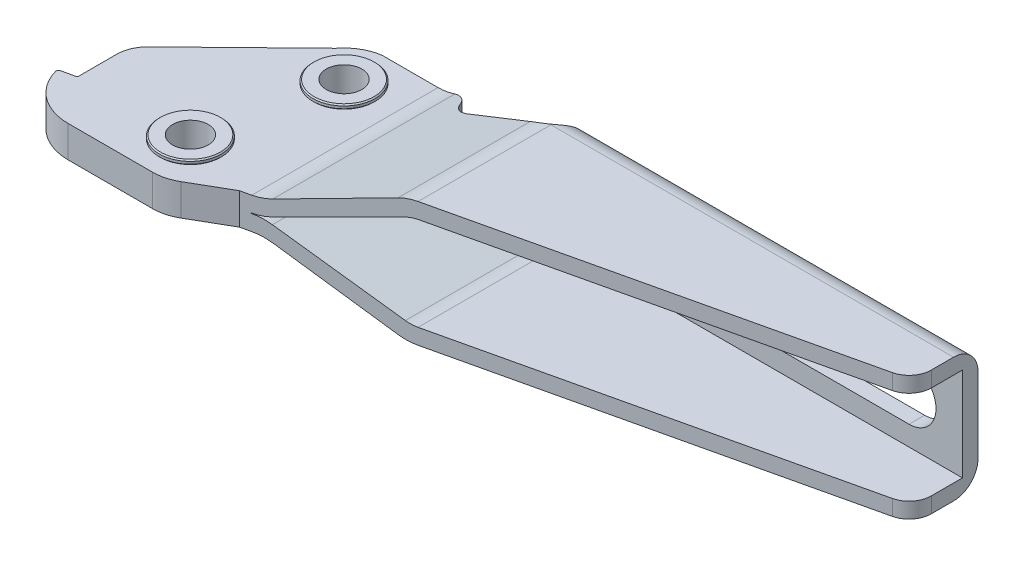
ISO-10303-21;
HEADER;
FILE_DESCRIPTION(('STEP AP214'),'2;1');
FILE_NAME('part.step','',(''),(''),'','','');
FILE_SCHEMA(('AUTOMOTIVE_DESIGN { 1 0 10303 214 1 1 1 1 }'));
ENDSEC;
DATA;
#1=APPLICATION_CONTEXT('core data for automotive mechanical design processes');
#2=APPLICATION_PROTOCOL_DEFINITION('international standard','automotive_design',2000,#1);
#3=PRODUCT_CONTEXT('',#1,'mechanical');
#4=PRODUCT('Part','Part','',(#3));
#5=PRODUCT_RELATED_PRODUCT_CATEGORY('part','',(#4));
#6=PRODUCT_DEFINITION_FORMATION('','',#4);
#7=PRODUCT_DEFINITION_CONTEXT('part definition',#1,'design');
#8=PRODUCT_DEFINITION('design','',#6,#7);
#9=PRODUCT_DEFINITION_SHAPE('','',#8);
#10=(LENGTH_UNIT() NAMED_UNIT(*) SI_UNIT(.MILLI.,.METRE.));
#11=(NAMED_UNIT(*) PLANE_ANGLE_UNIT() SI_UNIT($,.RADIAN.));
#12=(NAMED_UNIT(*) SI_UNIT($,.STERADIAN.) SOLID_ANGLE_UNIT());
#13=UNCERTAINTY_MEASURE_WITH_UNIT(LENGTH_MEASURE(1.E-05),#10,'distance_accuracy_value','');
#14=(GEOMETRIC_REPRESENTATION_CONTEXT(3) GLOBAL_UNCERTAINTY_ASSIGNED_CONTEXT((#13)) GLOBAL_UNIT_ASSIGNED_CONTEXT((#10,
#11,#12)) REPRESENTATION_CONTEXT('',''));
#15=CARTESIAN_POINT('',(0.,0.,0.));
#16=DIRECTION('',(0.,0.,1.));
#17=DIRECTION('',(1.,0.,0.));
#18=AXIS2_PLACEMENT_3D('',#15,#16,#17);
#19=CARTESIAN_POINT('',(0.,-4.55,0.));
#20=DIRECTION('',(0.,1.,0.));
#21=DIRECTION('',(0.739865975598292,0.,0.672754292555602));
#22=AXIS2_PLACEMENT_3D('',#19,#20,#21);
#23=CYLINDRICAL_SURFACE('',#22,4.);
#24=CARTESIAN_POINT('',(0.,4.6,0.));
#25=DIRECTION('',(0.,1.,0.));
#26=DIRECTION('',(-1.,0.,0.));
#27=AXIS2_PLACEMENT_3D('',#24,#25,#26);
#28=CIRCLE('',#27,4.);
#29=CARTESIAN_POINT('',(-4.,4.6,0.));
#30=VERTEX_POINT('',#29);
#31=EDGE_CURVE('E1077',#30,#30,#28,.T.);
#32=ORIENTED_EDGE('',*,*,#31,.T.);
#33=EDGE_LOOP('',(#32));
#34=FACE_BOUND('',#33,.T.);
#35=CARTESIAN_POINT('',(0.,-4.6,0.));
#36=DIRECTION('',(0.,-1.,0.));
#37=DIRECTION('',(1.,0.,0.));
#38=AXIS2_PLACEMENT_3D('',#35,#36,#37);
#39=CIRCLE('',#38,4.);
#40=CARTESIAN_POINT('',(4.,-4.6,0.));
#41=VERTEX_POINT('',#40);
#42=EDGE_CURVE('E1084',#41,#41,#39,.F.);
#43=ORIENTED_EDGE('',*,*,#42,.F.);
#44=EDGE_LOOP('',(#43));
#45=FACE_BOUND('',#44,.T.);
#46=ADVANCED_FACE('F14',(#34,#45),#23,.F.);
#47=CARTESIAN_POINT('',(0.,-3.55,0.));
#48=DIRECTION('',(0.,-1.,0.));
#49=DIRECTION('',(-0.739865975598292,0.,-0.672754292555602));
#50=AXIS2_PLACEMENT_3D('',#47,#48,#49);
#51=CYLINDRICAL_SURFACE('',#50,7.5);
#52=CARTESIAN_POINT('',(0.,-4.35,0.));
#53=DIRECTION('',(0.,-1.,0.));
#54=DIRECTION('',(1.,0.,0.));
#55=AXIS2_PLACEMENT_3D('',#52,#53,#54);
#56=CIRCLE('',#55,7.5);
#57=CARTESIAN_POINT('',(7.49999999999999,-4.35,0.));
#58=VERTEX_POINT('',#57);
#59=EDGE_CURVE('E1142',#58,#58,#56,.F.);
#60=ORIENTED_EDGE('',*,*,#59,.T.);
#61=EDGE_LOOP('',(#60));
#62=FACE_BOUND('',#61,.T.);
#63=CARTESIAN_POINT('',(0.,-3.75,0.));
#64=DIRECTION('',(0.,-1.,0.));
#65=DIRECTION('',(-0.739865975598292,0.,-0.672754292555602));
#66=AXIS2_PLACEMENT_3D('',#63,#64,#65);
#67=CIRCLE('',#66,7.5);
#68=CARTESIAN_POINT('',(-5.5489948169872,-3.75,-5.045657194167));
#69=VERTEX_POINT('',#68);
#70=EDGE_CURVE('E1076',#69,#69,#67,.T.);
#71=ORIENTED_EDGE('',*,*,#70,.T.);
#72=EDGE_LOOP('',(#71));
#73=FACE_BOUND('',#72,.T.);
#74=ADVANCED_FACE('F995',(#62,#73),#51,.T.);
#75=CARTESIAN_POINT('',(-6.48,-4.55,28.06));
#76=DIRECTION('',(0.,1.,0.));
#77=DIRECTION('',(0.739865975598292,0.,0.672754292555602));
#78=AXIS2_PLACEMENT_3D('',#75,#76,#77);
#79=CYLINDRICAL_SURFACE('',#78,4.);
#80=CARTESIAN_POINT('',(-6.48,4.6,28.06));
#81=DIRECTION('',(0.,1.,0.));
#82=DIRECTION('',(-1.,0.,0.));
#83=AXIS2_PLACEMENT_3D('',#80,#81,#82);
#84=CIRCLE('',#83,4.);
#85=CARTESIAN_POINT('',(-10.48,4.6,28.06));
#86=VERTEX_POINT('',#85);
#87=EDGE_CURVE('E369',#86,#86,#84,.T.);
#88=ORIENTED_EDGE('',*,*,#87,.T.);
#89=EDGE_LOOP('',(#88));
#90=FACE_BOUND('',#89,.T.);
#91=CARTESIAN_POINT('',(-6.48,-4.6,28.06));
#92=DIRECTION('',(0.,-1.,0.));
#93=DIRECTION('',(1.,0.,0.));
#94=AXIS2_PLACEMENT_3D('',#91,#92,#93);
#95=CIRCLE('',#94,4.);
#96=CARTESIAN_POINT('',(-2.48,-4.6,28.06));
#97=VERTEX_POINT('',#96);
#98=EDGE_CURVE('E1081',#97,#97,#95,.F.);
#99=ORIENTED_EDGE('',*,*,#98,.F.);
#100=EDGE_LOOP('',(#99));
#101=FACE_BOUND('',#100,.T.);
#102=ADVANCED_FACE('F1002',(#90,#101),#79,.F.);
#103=CARTESIAN_POINT('',(-6.48,-3.55,28.06));
#104=DIRECTION('',(0.,-1.,0.));
#105=DIRECTION('',(-0.739865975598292,0.,-0.672754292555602));
#106=AXIS2_PLACEMENT_3D('',#103,#104,#105);
#107=CYLINDRICAL_SURFACE('',#106,7.5);
#108=CARTESIAN_POINT('',(-6.48,-4.35,28.06));
#109=DIRECTION('',(0.,-1.,0.));
#110=DIRECTION('',(1.,0.,0.));
#111=AXIS2_PLACEMENT_3D('',#108,#109,#110);
#112=CIRCLE('',#111,7.5);
#113=CARTESIAN_POINT('',(1.02,-4.35,28.06));
#114=VERTEX_POINT('',#113);
#115=EDGE_CURVE('E1059',#114,#114,#112,.F.);
#116=ORIENTED_EDGE('',*,*,#115,.T.);
#117=EDGE_LOOP('',(#116));
#118=FACE_BOUND('',#117,.T.);
#119=CARTESIAN_POINT('',(-6.48,-3.75,28.06));
#120=DIRECTION('',(0.,-1.,0.));
#121=DIRECTION('',(-0.739865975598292,0.,-0.672754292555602));
#122=AXIS2_PLACEMENT_3D('',#119,#120,#121);
#123=CIRCLE('',#122,7.5);
#124=CARTESIAN_POINT('',(-12.0289948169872,-3.75,23.014342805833));
#125=VERTEX_POINT('',#124);
#126=EDGE_CURVE('E1136',#125,#125,#123,.T.);
#127=ORIENTED_EDGE('',*,*,#126,.T.);
#128=EDGE_LOOP('',(#127));
#129=FACE_BOUND('',#128,.T.);
#130=ADVANCED_FACE('F1010',(#118,#129),#107,.T.);
#131=CARTESIAN_POINT('',(0.,-4.55,0.));
#132=DIRECTION('',(0.,1.,0.));
#133=DIRECTION('',(0.739865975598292,0.,0.672754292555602));
#134=AXIS2_PLACEMENT_3D('',#131,#132,#133);
#135=CYLINDRICAL_SURFACE('',#134,7.);
#136=CARTESIAN_POINT('',(0.,4.35,0.));
#137=DIRECTION('',(0.,1.,0.));
#138=DIRECTION('',(-1.,0.,0.));
#139=AXIS2_PLACEMENT_3D('',#136,#137,#138);
#140=CIRCLE('',#139,7.);
#141=CARTESIAN_POINT('',(-7.,4.35,0.));
#142=VERTEX_POINT('',#141);
#143=EDGE_CURVE('E1054',#142,#142,#140,.F.);
#144=ORIENTED_EDGE('',*,*,#143,.T.);
#145=EDGE_LOOP('',(#144));
#146=FACE_BOUND('',#145,.T.);
#147=CARTESIAN_POINT('',(0.,3.8,0.));
#148=DIRECTION('',(0.,1.,0.));
#149=DIRECTION('',(0.739865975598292,0.,0.672754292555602));
#150=AXIS2_PLACEMENT_3D('',#147,#148,#149);
#151=CIRCLE('',#150,7.);
#152=CARTESIAN_POINT('',(5.17906182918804,3.8,4.70928004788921));
#153=VERTEX_POINT('',#152);
#154=EDGE_CURVE('E357',#153,#153,#151,.T.);
#155=ORIENTED_EDGE('',*,*,#154,.T.);
#156=EDGE_LOOP('',(#155));
#157=FACE_BOUND('',#156,.T.);
#158=ADVANCED_FACE('F1013',(#146,#157),#135,.T.);
#159=CARTESIAN_POINT('',(-6.48,-4.55,28.06));
#160=DIRECTION('',(0.,1.,0.));
#161=DIRECTION('',(0.739865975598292,0.,0.672754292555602));
#162=AXIS2_PLACEMENT_3D('',#159,#160,#161);
#163=CYLINDRICAL_SURFACE('',#162,7.);
#164=CARTESIAN_POINT('',(-6.48,4.34999999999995,28.06));
#165=DIRECTION('',(0.,1.,0.));
#166=DIRECTION('',(-1.,0.,0.));
#167=AXIS2_PLACEMENT_3D('',#164,#165,#166);
#168=CIRCLE('',#167,7.);
#169=CARTESIAN_POINT('',(-13.48,4.34999999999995,28.06));
#170=VERTEX_POINT('',#169);
#171=EDGE_CURVE('E9',#170,#170,#168,.F.);
#172=ORIENTED_EDGE('',*,*,#171,.T.);
#173=EDGE_LOOP('',(#172));
#174=FACE_BOUND('',#173,.T.);
#175=CARTESIAN_POINT('',(-6.48,3.8,28.06));
#176=DIRECTION('',(0.,1.,0.));
#177=DIRECTION('',(0.739865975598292,0.,0.672754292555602));
#178=AXIS2_PLACEMENT_3D('',#175,#176,#177);
#179=CIRCLE('',#178,7.);
#180=CARTESIAN_POINT('',(-1.30093817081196,3.8,32.7692800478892));
#181=VERTEX_POINT('',#180);
#182=EDGE_CURVE('E1079',#181,#181,#179,.T.);
#183=ORIENTED_EDGE('',*,*,#182,.T.);
#184=EDGE_LOOP('',(#183));
#185=FACE_BOUND('',#184,.T.);
#186=ADVANCED_FACE('F1020',(#174,#185),#163,.T.);
#187=CARTESIAN_POINT('',(0.,-3.55,0.));
#188=DIRECTION('',(0.,-1.,0.));
#189=DIRECTION('',(-0.739865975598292,0.,-0.672754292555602));
#190=AXIS2_PLACEMENT_3D('',#187,#188,#189);
#191=CONICAL_SURFACE('',#190,7.3,0.785398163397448);
#192=ORIENTED_EDGE('',*,*,#70,.F.);
#193=EDGE_LOOP('',(#192));
#194=FACE_BOUND('',#193,.T.);
#195=CARTESIAN_POINT('',(0.,-3.55,0.));
#196=DIRECTION('',(0.,-1.,0.));
#197=DIRECTION('',(0.,0.,1.));
#198=AXIS2_PLACEMENT_3D('',#195,#196,#197);
#199=CIRCLE('',#198,7.3);
#200=CARTESIAN_POINT('',(0.,-3.55,7.30000000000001));
#201=VERTEX_POINT('',#200);
#202=EDGE_CURVE('E1120',#201,#201,#199,.F.);
#203=ORIENTED_EDGE('',*,*,#202,.F.);
#204=EDGE_LOOP('',(#203));
#205=FACE_BOUND('',#204,.T.);
#206=ADVANCED_FACE('F1023',(#194,#205),#191,.T.);
#207=CARTESIAN_POINT('',(0.,3.55,0.));
#208=DIRECTION('',(0.,1.,0.));
#209=DIRECTION('',(0.739865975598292,0.,0.672754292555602));
#210=AXIS2_PLACEMENT_3D('',#207,#208,#209);
#211=CONICAL_SURFACE('',#210,6.75,0.785398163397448);
#212=ORIENTED_EDGE('',*,*,#154,.F.);
#213=EDGE_LOOP('',(#212));
#214=FACE_BOUND('',#213,.T.);
#215=CARTESIAN_POINT('',(0.,3.55,0.));
#216=DIRECTION('',(0.,1.,0.));
#217=DIRECTION('',(0.,0.,-1.));
#218=AXIS2_PLACEMENT_3D('',#215,#216,#217);
#219=CIRCLE('',#218,6.75);
#220=CARTESIAN_POINT('',(0.,3.55,-6.75));
#221=VERTEX_POINT('',#220);
#222=EDGE_CURVE('E1130',#221,#221,#219,.F.);
#223=ORIENTED_EDGE('',*,*,#222,.F.);
#224=EDGE_LOOP('',(#223));
#225=FACE_BOUND('',#224,.T.);
#226=ADVANCED_FACE('F507',(#214,#225),#211,.T.);
#227=CARTESIAN_POINT('',(-6.48,-3.55,28.06));
#228=DIRECTION('',(0.,-1.,0.));
#229=DIRECTION('',(-0.739865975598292,0.,-0.672754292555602));
#230=AXIS2_PLACEMENT_3D('',#227,#228,#229);
#231=CONICAL_SURFACE('',#230,7.3,0.785398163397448);
#232=ORIENTED_EDGE('',*,*,#126,.F.);
#233=EDGE_LOOP('',(#232));
#234=FACE_BOUND('',#233,.T.);
#235=CARTESIAN_POINT('',(-6.48,-3.55,28.06));
#236=DIRECTION('',(0.,-1.,0.));
#237=DIRECTION('',(0.,0.,1.));
#238=AXIS2_PLACEMENT_3D('',#235,#236,#237);
#239=CIRCLE('',#238,7.3);
#240=CARTESIAN_POINT('',(-6.48,-3.55,35.36));
#241=VERTEX_POINT('',#240);
#242=EDGE_CURVE('E1122',#241,#241,#239,.F.);
#243=ORIENTED_EDGE('',*,*,#242,.F.);
#244=EDGE_LOOP('',(#243));
#245=FACE_BOUND('',#244,.T.);
#246=ADVANCED_FACE('F1015',(#234,#245),#231,.T.);
#247=CARTESIAN_POINT('',(-6.48,3.55,28.06));
#248=DIRECTION('',(0.,1.,0.));
#249=DIRECTION('',(0.739865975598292,0.,0.672754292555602));
#250=AXIS2_PLACEMENT_3D('',#247,#248,#249);
#251=CONICAL_SURFACE('',#250,6.75,0.785398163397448);
#252=ORIENTED_EDGE('',*,*,#182,.F.);
#253=EDGE_LOOP('',(#252));
#254=FACE_BOUND('',#253,.T.);
#255=CARTESIAN_POINT('',(-6.48,3.55,28.06));
#256=DIRECTION('',(0.,1.,0.));
#257=DIRECTION('',(0.,0.,-1.));
#258=AXIS2_PLACEMENT_3D('',#255,#256,#257);
#259=CIRCLE('',#258,6.75);
#260=CARTESIAN_POINT('',(-6.48,3.55,21.31));
#261=VERTEX_POINT('',#260);
#262=EDGE_CURVE('E1125',#261,#261,#259,.F.);
#263=ORIENTED_EDGE('',*,*,#262,.F.);
#264=EDGE_LOOP('',(#263));
#265=FACE_BOUND('',#264,.T.);
#266=ADVANCED_FACE('F1018',(#254,#265),#251,.T.);
#267=CARTESIAN_POINT('',(56.,0.,-15.));
#268=DIRECTION('',(0.,0.,1.));
#269=DIRECTION('',(0.,1.,0.));
#270=AXIS2_PLACEMENT_3D('',#267,#268,#269);
#271=CYLINDRICAL_SURFACE('',#270,6.05);
#272=CARTESIAN_POINT('',(56.,0.,-10.5));
#273=DIRECTION('',(0.,0.,-1.));
#274=DIRECTION('',(0.,-1.,0.));
#275=AXIS2_PLACEMENT_3D('',#272,#273,#274);
#276=CIRCLE('',#275,6.05);
#277=CARTESIAN_POINT('',(56.,-6.05,-10.5));
#278=VERTEX_POINT('',#277);
#279=CARTESIAN_POINT('',(56.,6.05,-10.5));
#280=VERTEX_POINT('',#279);
#281=EDGE_CURVE('E348',#278,#280,#276,.T.);
#282=ORIENTED_EDGE('',*,*,#281,.T.);
#283=DIRECTION('',(0.,0.,1.));
#284=VECTOR('',#283,1.);
#285=CARTESIAN_POINT('',(56.,6.05,-15.));
#286=LINE('',#285,#284);
#287=CARTESIAN_POINT('',(56.,6.05,-7.));
#288=VERTEX_POINT('',#287);
#289=EDGE_CURVE('E375',#280,#288,#286,.T.);
#290=ORIENTED_EDGE('',*,*,#289,.T.);
#291=CARTESIAN_POINT('',(56.,0.,-7.));
#292=DIRECTION('',(0.,0.,1.));
#293=DIRECTION('',(1.,0.,0.));
#294=AXIS2_PLACEMENT_3D('',#291,#292,#293);
#295=CIRCLE('',#294,6.05);
#296=CARTESIAN_POINT('',(56.,-6.05,-7.));
#297=VERTEX_POINT('',#296);
#298=EDGE_CURVE('E366',#288,#297,#295,.T.);
#299=ORIENTED_EDGE('',*,*,#298,.T.);
#300=DIRECTION('',(0.,0.,1.));
#301=VECTOR('',#300,1.);
#302=CARTESIAN_POINT('',(56.,-6.05,-15.));
#303=LINE('',#302,#301);
#304=EDGE_CURVE('E29',#278,#297,#303,.T.);
#305=ORIENTED_EDGE('',*,*,#304,.F.);
#306=EDGE_LOOP('',(#282,#290,#299,#305));
#307=FACE_BOUND('',#306,.T.);
#308=ADVANCED_FACE('F1027',(#307),#271,.F.);
#309=CARTESIAN_POINT('',(120.,6.05,-15.));
#310=DIRECTION('',(0.,1.,0.));
#311=DIRECTION('',(-1.,0.,0.));
#312=AXIS2_PLACEMENT_3D('',#309,#310,#311);
#313=PLANE('',#312);
#314=DIRECTION('',(1.,0.,0.));
#315=VECTOR('',#314,1.);
#316=CARTESIAN_POINT('',(132.,6.05,-10.5));
#317=LINE('',#316,#315);
#318=CARTESIAN_POINT('',(120.,6.05,-10.5));
#319=VERTEX_POINT('',#318);
#320=EDGE_CURVE('E379',#280,#319,#317,.T.);
#321=ORIENTED_EDGE('',*,*,#320,.T.);
#322=DIRECTION('',(0.,0.,1.));
#323=VECTOR('',#322,1.);
#324=CARTESIAN_POINT('',(120.,6.05,-15.));
#325=LINE('',#324,#323);
#326=CARTESIAN_POINT('',(120.,6.05,-7.));
#327=VERTEX_POINT('',#326);
#328=EDGE_CURVE('E349',#319,#327,#325,.T.);
#329=ORIENTED_EDGE('',*,*,#328,.T.);
#330=DIRECTION('',(-1.,0.,0.));
#331=VECTOR('',#330,1.);
#332=CARTESIAN_POINT('',(120.,6.05,-7.));
#333=LINE('',#332,#331);
#334=EDGE_CURVE('E37',#327,#288,#333,.T.);
#335=ORIENTED_EDGE('',*,*,#334,.T.);
#336=ORIENTED_EDGE('',*,*,#289,.F.);
#337=EDGE_LOOP('',(#321,#329,#335,#336));
#338=FACE_BOUND('',#337,.T.);
#339=ADVANCED_FACE('F1106',(#338),#313,.F.);
#340=CARTESIAN_POINT('',(120.,0.,-15.));
#341=DIRECTION('',(0.,0.,1.));
#342=DIRECTION('',(0.,1.,0.));
#343=AXIS2_PLACEMENT_3D('',#340,#341,#342);
#344=CYLINDRICAL_SURFACE('',#343,6.05);
#345=CARTESIAN_POINT('',(120.,0.,-10.5));
#346=DIRECTION('',(0.,0.,-1.));
#347=DIRECTION('',(0.,-1.,0.));
#348=AXIS2_PLACEMENT_3D('',#345,#346,#347);
#349=CIRCLE('',#348,6.05);
#350=CARTESIAN_POINT('',(120.,-6.05,-10.5));
#351=VERTEX_POINT('',#350);
#352=EDGE_CURVE('E345',#319,#351,#349,.T.);
#353=ORIENTED_EDGE('',*,*,#352,.T.);
#354=DIRECTION('',(0.,0.,1.));
#355=VECTOR('',#354,1.);
#356=CARTESIAN_POINT('',(120.,-6.05,-15.));
#357=LINE('',#356,#355);
#358=CARTESIAN_POINT('',(120.,-6.05,-7.));
#359=VERTEX_POINT('',#358);
#360=EDGE_CURVE('E338',#351,#359,#357,.T.);
#361=ORIENTED_EDGE('',*,*,#360,.T.);
#362=CARTESIAN_POINT('',(120.,0.,-7.));
#363=DIRECTION('',(0.,0.,1.));
#364=DIRECTION('',(-1.,0.,0.));
#365=AXIS2_PLACEMENT_3D('',#362,#363,#364);
#366=CIRCLE('',#365,6.05);
#367=EDGE_CURVE('E343',#359,#327,#366,.T.);
#368=ORIENTED_EDGE('',*,*,#367,.T.);
#369=ORIENTED_EDGE('',*,*,#328,.F.);
#370=EDGE_LOOP('',(#353,#361,#368,#369));
#371=FACE_BOUND('',#370,.T.);
#372=ADVANCED_FACE('F340',(#371),#344,.F.);
#373=CARTESIAN_POINT('',(56.,-6.05,-15.));
#374=DIRECTION('',(0.,-1.,0.));
#375=DIRECTION('',(1.,0.,0.));
#376=AXIS2_PLACEMENT_3D('',#373,#374,#375);
#377=PLANE('',#376);
#378=DIRECTION('',(-1.,0.,0.));
#379=VECTOR('',#378,1.);
#380=CARTESIAN_POINT('',(132.,-6.05,-10.5));
#381=LINE('',#380,#379);
#382=EDGE_CURVE('E382',#351,#278,#381,.T.);
#383=ORIENTED_EDGE('',*,*,#382,.T.);
#384=ORIENTED_EDGE('',*,*,#304,.T.);
#385=DIRECTION('',(1.,0.,0.));
#386=VECTOR('',#385,1.);
#387=CARTESIAN_POINT('',(56.,-6.05,-7.));
#388=LINE('',#387,#386);
#389=EDGE_CURVE('E352',#297,#359,#388,.T.);
#390=ORIENTED_EDGE('',*,*,#389,.T.);
#391=ORIENTED_EDGE('',*,*,#360,.F.);
#392=EDGE_LOOP('',(#383,#384,#390,#391));
#393=FACE_BOUND('',#392,.T.);
#394=ADVANCED_FACE('F353',(#393),#377,.F.);
#395=CARTESIAN_POINT('',(132.,-8.5,-5.));
#396=DIRECTION('',(-1.,0.,0.));
#397=DIRECTION('',(0.,-1.,0.));
#398=AXIS2_PLACEMENT_3D('',#395,#396,#397);
#399=CYLINDRICAL_SURFACE('',#398,5.5);
#400=CARTESIAN_POINT('',(44.,-8.5,-5.));
#401=DIRECTION('',(-1.,0.,0.));
#402=DIRECTION('',(0.,-1.,0.));
#403=AXIS2_PLACEMENT_3D('',#400,#401,#402);
#404=CIRCLE('',#403,5.5);
#405=CARTESIAN_POINT('',(44.,-10.2916472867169,-10.2));
#406=VERTEX_POINT('',#405);
#407=CARTESIAN_POINT('',(44.,-8.5,-10.5));
#408=VERTEX_POINT('',#407);
#409=EDGE_CURVE('E798',#406,#408,#404,.F.);
#410=ORIENTED_EDGE('',*,*,#409,.T.);
#411=DIRECTION('',(-1.,0.,0.));
#412=VECTOR('',#411,1.);
#413=CARTESIAN_POINT('',(132.,-8.5,-10.5));
#414=LINE('',#413,#412);
#415=CARTESIAN_POINT('',(132.,-8.5,-10.5));
#416=VERTEX_POINT('',#415);
#417=EDGE_CURVE('E395',#416,#408,#414,.T.);
#418=ORIENTED_EDGE('',*,*,#417,.F.);
#419=CARTESIAN_POINT('',(132.,-8.5,-5.));
#420=DIRECTION('',(1.,0.,0.));
#421=DIRECTION('',(0.,0.,1.));
#422=AXIS2_PLACEMENT_3D('',#419,#420,#421);
#423=CIRCLE('',#422,5.5);
#424=CARTESIAN_POINT('',(132.,-14.,-5.));
#425=VERTEX_POINT('',#424);
#426=EDGE_CURVE('E384',#425,#416,#423,.T.);
#427=ORIENTED_EDGE('',*,*,#426,.F.);
#428=DIRECTION('',(-1.,0.,0.));
#429=VECTOR('',#428,1.);
#430=CARTESIAN_POINT('',(132.,-14.,-5.));
#431=LINE('',#430,#429);
#432=CARTESIAN_POINT('',(41.51,-14.,-5.));
#433=VERTEX_POINT('',#432);
#434=EDGE_CURVE('E398',#425,#433,#431,.T.);
#435=ORIENTED_EDGE('',*,*,#434,.T.);
#436=CARTESIAN_POINT('',(40.9459044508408,-13.9840771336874,-5.41820807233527));
#437=CARTESIAN_POINT('',(41.1285544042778,-13.9943901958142,-5.28284083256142));
#438=CARTESIAN_POINT('',(41.3112314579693,-13.9996935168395,-5.1474093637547));
#439=CARTESIAN_POINT('',(41.4992903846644,-13.9999957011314,-5.00794249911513));
#440=CARTESIAN_POINT('',(41.5046451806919,-14.0000000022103,-5.00397127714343));
#441=CARTESIAN_POINT('',(41.5099999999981,-14.,-5.));
#442=B_SPLINE_CURVE_WITH_KNOTS('',3,(#436,#437,#438,#439,#440,#441),.UNSPECIFIED.,.F.,.F.,(4,2,
4),(0.,0.682397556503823,0.702397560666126),.UNSPECIFIED.);
#443=CARTESIAN_POINT('',(41.351191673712,-13.9987389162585,-5.11777236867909));
#444=VERTEX_POINT('',#443);
#445=EDGE_CURVE('E435',#433,#444,#442,.F.);
#446=ORIENTED_EDGE('',*,*,#445,.T.);
#447=CARTESIAN_POINT('',(41.1763886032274,-14.,-5.));
#448=CARTESIAN_POINT('',(41.2973438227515,-13.9999932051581,-5.07851504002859));
#449=CARTESIAN_POINT('',(41.4155681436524,-13.9983182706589,-5.16129845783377));
#450=CARTESIAN_POINT('',(41.6459560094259,-13.9904853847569,-5.33488120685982));
#451=CARTESIAN_POINT('',(41.7581148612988,-13.9843240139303,-5.42568660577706));
#452=CARTESIAN_POINT('',(41.9761730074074,-13.9663195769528,-5.6151808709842));
#453=CARTESIAN_POINT('',(42.0820352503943,-13.9544460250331,-5.71390964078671));
#454=CARTESIAN_POINT('',(42.2860949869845,-13.9238332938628,-5.91797242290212));
#455=CARTESIAN_POINT('',(42.3842943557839,-13.9050958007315,-6.02330480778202));
#456=CARTESIAN_POINT('',(42.5729337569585,-13.8594975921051,-6.24021666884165));
#457=CARTESIAN_POINT('',(42.6633230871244,-13.8325882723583,-6.35183017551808));
#458=CARTESIAN_POINT('',(42.8350422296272,-13.7696674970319,-6.57941061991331));
#459=CARTESIAN_POINT('',(42.9163714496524,-13.7336554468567,-6.69537784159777));
#460=CARTESIAN_POINT('',(43.0692067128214,-13.651859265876,-6.92968551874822));
#461=CARTESIAN_POINT('',(43.1407462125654,-13.6061098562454,-7.04801622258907));
#462=CARTESIAN_POINT('',(43.274064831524,-13.5042288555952,-7.28569478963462));
#463=CARTESIAN_POINT('',(43.3358452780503,-13.4480986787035,-7.40504251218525));
#464=CARTESIAN_POINT('',(43.4435163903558,-13.331875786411,-7.63006489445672));
#465=CARTESIAN_POINT('',(43.4904024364,-13.2728650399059,-7.73582469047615));
#466=CARTESIAN_POINT('',(43.5766383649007,-13.1464687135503,-7.94538571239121));
#467=CARTESIAN_POINT('',(43.615988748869,-13.0790836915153,-8.04918706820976));
#468=CARTESIAN_POINT('',(43.6875848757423,-12.9361068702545,-8.25369633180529));
#469=CARTESIAN_POINT('',(43.7198234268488,-12.8605068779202,-8.35440102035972));
#470=CARTESIAN_POINT('',(43.7777035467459,-12.7015475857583,-8.55148222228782));
#471=CARTESIAN_POINT('',(43.803345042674,-12.6181882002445,-8.64785868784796));
#472=CARTESIAN_POINT('',(43.8481303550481,-12.4464382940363,-8.83290397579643));
#473=CARTESIAN_POINT('',(43.8674233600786,-12.3582305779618,-8.92170676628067));
#474=CARTESIAN_POINT('',(43.9010980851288,-12.1754236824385,-9.09353206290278));
#475=CARTESIAN_POINT('',(43.9154779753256,-12.0808221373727,-9.17655240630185));
#476=CARTESIAN_POINT('',(43.9400521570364,-11.8858340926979,-9.33612643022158));
#477=CARTESIAN_POINT('',(43.9502472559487,-11.7854487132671,-9.41268135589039));
#478=CARTESIAN_POINT('',(43.9671968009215,-11.5794499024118,-9.55883276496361));
#479=CARTESIAN_POINT('',(43.9739503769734,-11.4738351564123,-9.62842748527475));
#480=CARTESIAN_POINT('',(43.9878036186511,-11.1965800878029,-9.79768051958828));
#481=CARTESIAN_POINT('',(43.992921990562,-11.0215037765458,-9.89196866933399));
#482=CARTESIAN_POINT('',(43.9974906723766,-10.7523041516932,-10.0186614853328));
#483=CARTESIAN_POINT('',(43.9984959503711,-10.6615651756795,-10.0584042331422));
#484=CARTESIAN_POINT('',(43.9997483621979,-10.4780650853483,-10.1329382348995));
#485=CARTESIAN_POINT('',(43.9999954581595,-10.3853038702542,-10.1677292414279));
#486=CARTESIAN_POINT('',(44.,-10.2916472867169,-10.2));
#487=B_SPLINE_CURVE_WITH_KNOTS('',3,(#447,#448,#449,#450,#451,#452,#453,#454,#455,#456,#457,
#458,#459,#460,#461,#462,#463,#464,#465,#466,#467,#468,#469,#470,#471,#472,#473,#474,#475,#476,
#477,#478,#479,#480,#481,#482,#483,#484,#485,#486),.UNSPECIFIED.,.F.,.F.,(4,2,2,2,2,2,2,2,2,2,2,
2,2,2,2,2,2,2,2,4),(0.,0.432565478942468,0.865460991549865,1.30069292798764,1.73581802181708,
2.17358359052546,2.61137776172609,3.04763625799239,3.48383536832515,3.87294362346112,
4.26202597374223,4.65149999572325,5.04097831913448,5.42051210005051,5.8001870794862,
6.17978877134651,6.5594863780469,7.15480074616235,7.45187862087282,7.74897133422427),.UNSPECIFIED.);
#488=EDGE_CURVE('E797',#444,#406,#487,.T.);
#489=ORIENTED_EDGE('',*,*,#488,.T.);
#490=EDGE_LOOP('',(#410,#418,#427,#435,#446,#489));
#491=FACE_BOUND('',#490,.T.);
#492=ADVANCED_FACE('F420',(#491),#399,.T.);
#493=CARTESIAN_POINT('',(132.,8.5,-5.));
#494=DIRECTION('',(-1.,0.,0.));
#495=DIRECTION('',(0.,-1.,0.));
#496=AXIS2_PLACEMENT_3D('',#493,#494,#495);
#497=CYLINDRICAL_SURFACE('',#496,5.5);
#498=CARTESIAN_POINT('',(44.,8.5,-5.));
#499=DIRECTION('',(-1.,0.,0.));
#500=DIRECTION('',(0.,-1.,0.));
#501=AXIS2_PLACEMENT_3D('',#498,#499,#500);
#502=CIRCLE('',#501,5.5);
#503=CARTESIAN_POINT('',(44.,8.5,-10.5));
#504=VERTEX_POINT('',#503);
#505=CARTESIAN_POINT('',(44.,10.2916472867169,-10.2));
#506=VERTEX_POINT('',#505);
#507=EDGE_CURVE('E408',#504,#506,#502,.F.);
#508=ORIENTED_EDGE('',*,*,#507,.T.);
#509=CARTESIAN_POINT('',(44.,10.2916472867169,-10.2));
#510=CARTESIAN_POINT('',(43.9999776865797,10.4288697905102,-10.1527363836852));
#511=CARTESIAN_POINT('',(43.9994590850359,10.564220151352,-10.1000101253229));
#512=CARTESIAN_POINT('',(43.9965146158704,10.8303568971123,-9.98402143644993));
#513=CARTESIAN_POINT('',(43.9940881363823,10.9611418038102,-9.9207556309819));
#514=CARTESIAN_POINT('',(43.9863952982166,11.2177980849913,-9.78380938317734));
#515=CARTESIAN_POINT('',(43.9811165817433,11.3436455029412,-9.71008465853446));
#516=CARTESIAN_POINT('',(43.9666527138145,11.5889256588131,-9.55299255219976));
#517=CARTESIAN_POINT('',(43.957467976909,11.7083590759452,-9.46962619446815));
#518=CARTESIAN_POINT('',(43.934035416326,11.9403563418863,-9.29362568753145));
#519=CARTESIAN_POINT('',(43.9197695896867,12.0528940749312,-9.20095943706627));
#520=CARTESIAN_POINT('',(43.8850337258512,12.2697363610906,-9.00751688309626));
#521=CARTESIAN_POINT('',(43.8645644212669,12.3740418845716,-8.90674153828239));
#522=CARTESIAN_POINT('',(43.8163758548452,12.5733391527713,-8.69846291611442));
#523=CARTESIAN_POINT('',(43.7886752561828,12.6683540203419,-8.59097749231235));
#524=CARTESIAN_POINT('',(43.7250140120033,12.8486282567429,-8.37041697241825));
#525=CARTESIAN_POINT('',(43.6890543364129,12.9338887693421,-8.25734253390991));
#526=CARTESIAN_POINT('',(43.6112991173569,13.0877325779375,-8.03634248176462));
#527=CARTESIAN_POINT('',(43.5701936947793,13.1571025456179,-7.928720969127));
#528=CARTESIAN_POINT('',(43.4798829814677,13.2868479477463,-7.71147398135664));
#529=CARTESIAN_POINT('',(43.4306781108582,13.3472238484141,-7.60184861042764));
#530=CARTESIAN_POINT('',(43.323947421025,13.4589433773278,-7.38203384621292));
#531=CARTESIAN_POINT('',(43.2664207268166,13.5102860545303,-7.27184439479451));
#532=CARTESIAN_POINT('',(43.1430541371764,13.6041209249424,-7.05236321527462));
#533=CARTESIAN_POINT('',(43.0772144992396,13.646613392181,-6.94307145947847));
#534=CARTESIAN_POINT('',(42.9423114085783,13.720493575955,-6.734312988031));
#535=CARTESIAN_POINT('',(42.8737938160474,13.7524494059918,-6.6346929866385));
#536=CARTESIAN_POINT('',(42.7300067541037,13.8095707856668,-6.43837217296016));
#537=CARTESIAN_POINT('',(42.6547347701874,13.8347337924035,-6.3416724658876));
#538=CARTESIAN_POINT('',(42.4977939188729,13.8788715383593,-6.15205182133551));
#539=CARTESIAN_POINT('',(42.4161218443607,13.897843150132,-6.05913281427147));
#540=CARTESIAN_POINT('',(42.2468382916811,13.9302739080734,-5.87784446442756));
#541=CARTESIAN_POINT('',(42.1592252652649,13.9437316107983,-5.78947631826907));
#542=CARTESIAN_POINT('',(41.9314334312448,13.9716285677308,-5.57321844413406));
#543=CARTESIAN_POINT('',(41.7876280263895,13.9829335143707,-5.44869539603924));
#544=CARTESIAN_POINT('',(41.5639698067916,13.9935663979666,-5.27237047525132));
#545=CARTESIAN_POINT('',(41.4882228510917,13.996057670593,-5.21542371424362));
#546=CARTESIAN_POINT('',(41.3341794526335,13.9992730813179,-5.10504728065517));
#547=CARTESIAN_POINT('',(41.2558832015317,13.9999973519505,-5.05161734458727));
#548=CARTESIAN_POINT('',(41.1763886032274,14.,-5.));
#549=B_SPLINE_CURVE_WITH_KNOTS('',3,(#509,#510,#511,#512,#513,#514,#515,#516,#517,#518,#519,
#520,#521,#522,#523,#524,#525,#526,#527,#528,#529,#530,#531,#532,#533,#534,#535,#536,#537,#538,
#539,#540,#541,#542,#543,#544,#545,#546,#547,#548),.UNSPECIFIED.,.F.,.F.,(4,2,2,2,2,2,2,2,2,2,2,
2,2,2,2,2,2,2,2,4),(0.,0.435301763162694,0.870743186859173,1.3080865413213,1.74538349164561,
2.18424551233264,2.62305572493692,3.060744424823,3.49838174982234,3.90126876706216,
4.30413489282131,4.70704340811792,5.10993944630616,5.48471124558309,5.85962314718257,
6.23472413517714,6.60992325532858,7.18039165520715,7.46469413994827,7.7489752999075),.UNSPECIFIED.);
#550=CARTESIAN_POINT('',(41.351191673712,13.9987389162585,-5.11777236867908));
#551=VERTEX_POINT('',#550);
#552=EDGE_CURVE('E400',#506,#551,#549,.T.);
#553=ORIENTED_EDGE('',*,*,#552,.T.);
#554=CARTESIAN_POINT('',(40.9459044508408,13.9840771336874,-5.41820807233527));
#555=CARTESIAN_POINT('',(41.1285544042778,13.9943901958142,-5.28284083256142));
#556=CARTESIAN_POINT('',(41.3112314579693,13.9996935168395,-5.1474093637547));
#557=CARTESIAN_POINT('',(41.4992903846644,13.9999957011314,-5.00794249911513));
#558=CARTESIAN_POINT('',(41.5046451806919,14.0000000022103,-5.00397127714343));
#559=CARTESIAN_POINT('',(41.5099999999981,14.,-5.));
#560=B_SPLINE_CURVE_WITH_KNOTS('',3,(#554,#555,#556,#557,#558,#559),.UNSPECIFIED.,.F.,.F.,(4,2,
4),(0.,0.682397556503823,0.702397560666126),.UNSPECIFIED.);
#561=CARTESIAN_POINT('',(41.5099999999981,14.,-5.));
#562=VERTEX_POINT('',#561);
#563=EDGE_CURVE('E427',#551,#562,#560,.T.);
#564=ORIENTED_EDGE('',*,*,#563,.T.);
#565=DIRECTION('',(-1.,0.,0.));
#566=VECTOR('',#565,1.);
#567=CARTESIAN_POINT('',(132.,14.,-5.));
#568=LINE('',#567,#566);
#569=CARTESIAN_POINT('',(132.,14.,-5.));
#570=VERTEX_POINT('',#569);
#571=EDGE_CURVE('E390',#570,#562,#568,.T.);
#572=ORIENTED_EDGE('',*,*,#571,.F.);
#573=CARTESIAN_POINT('',(132.,8.5,-5.));
#574=DIRECTION('',(1.,0.,0.));
#575=DIRECTION('',(0.,0.,1.));
#576=AXIS2_PLACEMENT_3D('',#573,#574,#575);
#577=CIRCLE('',#576,5.5);
#578=CARTESIAN_POINT('',(132.,8.5,-10.5));
#579=VERTEX_POINT('',#578);
#580=EDGE_CURVE('E387',#579,#570,#577,.T.);
#581=ORIENTED_EDGE('',*,*,#580,.F.);
#582=DIRECTION('',(-1.,0.,0.));
#583=VECTOR('',#582,1.);
#584=CARTESIAN_POINT('',(132.,8.5,-10.5));
#585=LINE('',#584,#583);
#586=EDGE_CURVE('E393',#579,#504,#585,.T.);
#587=ORIENTED_EDGE('',*,*,#586,.T.);
#588=EDGE_LOOP('',(#508,#553,#564,#572,#581,#587));
#589=FACE_BOUND('',#588,.T.);
#590=ADVANCED_FACE('F414',(#589),#497,.T.);
#591=CARTESIAN_POINT('',(41.5100000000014,3.99999999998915,-7.));
#592=DIRECTION('',(0.,0.,1.));
#593=DIRECTION('',(0.,1.,0.));
#594=AXIS2_PLACEMENT_3D('',#591,#592,#593);
#595=PLANE('',#594);
#596=DIRECTION('',(-0.933560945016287,-0.358418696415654,0.));
#597=VECTOR('',#596,1.);
#598=CARTESIAN_POINT('',(39.180278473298,10.068146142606,-7.));
#599=LINE('',#598,#597);
#600=CARTESIAN_POINT('',(19.1961524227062,2.39571249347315,-7.));
#601=VERTEX_POINT('',#600);
#602=CARTESIAN_POINT('',(14.903396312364,0.74761007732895,-7.));
#603=VERTEX_POINT('',#602);
#604=EDGE_CURVE('E812',#601,#603,#599,.T.);
#605=ORIENTED_EDGE('',*,*,#604,.T.);
#606=CARTESIAN_POINT('',(11.1400000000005,10.5499999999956,-7.));
#607=DIRECTION('',(0.,0.,-1.));
#608=DIRECTION('',(-1.,0.,0.));
#609=AXIS2_PLACEMENT_3D('',#606,#607,#608);
#610=CIRCLE('',#609,10.4999999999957);
#611=CARTESIAN_POINT('',(10.995089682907,0.051,-7.));
#612=VERTEX_POINT('',#611);
#613=EDGE_CURVE('E816',#603,#612,#610,.T.);
#614=ORIENTED_EDGE('',*,*,#613,.T.);
#615=DIRECTION('',(0.,-1.,0.));
#616=VECTOR('',#615,1.);
#617=CARTESIAN_POINT('',(10.995089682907,0.051,-7.));
#618=LINE('',#617,#616);
#619=CARTESIAN_POINT('',(10.995089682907,-0.051,-7.));
#620=VERTEX_POINT('',#619);
#621=EDGE_CURVE('E820',#612,#620,#618,.T.);
#622=ORIENTED_EDGE('',*,*,#621,.T.);
#623=CARTESIAN_POINT('',(11.1400000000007,-10.5499999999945,-7.));
#624=DIRECTION('',(0.,0.,-1.));
#625=DIRECTION('',(-1.,0.,0.));
#626=AXIS2_PLACEMENT_3D('',#623,#624,#625);
#627=CIRCLE('',#626,10.4999999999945);
#628=CARTESIAN_POINT('',(14.903396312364,-0.74761007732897,-7.));
#629=VERTEX_POINT('',#628);
#630=EDGE_CURVE('E824',#620,#629,#627,.T.);
#631=ORIENTED_EDGE('',*,*,#630,.T.);
#632=DIRECTION('',(0.933560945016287,-0.358418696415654,0.));
#633=VECTOR('',#632,1.);
#634=CARTESIAN_POINT('',(14.903396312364,-0.74761007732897,-7.));
#635=LINE('',#634,#633);
#636=CARTESIAN_POINT('',(19.1961524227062,-2.39571249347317,-7.));
#637=VERTEX_POINT('',#636);
#638=EDGE_CURVE('E828',#629,#637,#635,.T.);
#639=ORIENTED_EDGE('',*,*,#638,.T.);
#640=DIRECTION('',(0.,1.,0.));
#641=VECTOR('',#640,1.);
#642=CARTESIAN_POINT('',(19.1961524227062,-14.,-7.));
#643=LINE('',#642,#641);
#644=EDGE_CURVE('E711',#601,#637,#643,.F.);
#645=ORIENTED_EDGE('',*,*,#644,.F.);
#646=EDGE_LOOP('',(#605,#614,#622,#631,#639,#645));
#647=FACE_BOUND('',#646,.T.);
#648=ADVANCED_FACE('F419',(#647),#595,.T.);
#649=CARTESIAN_POINT('',(41.5100000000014,-3.99999999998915,41.56));
#650=DIRECTION('',(0.,0.,-1.));
#651=DIRECTION('',(0.,-1.,0.));
#652=AXIS2_PLACEMENT_3D('',#649,#650,#651);
#653=CYLINDRICAL_SURFACE('',#652,6.50000000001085);
#654=DIRECTION('',(0.,0.,-1.));
#655=VECTOR('',#654,1.);
#656=CARTESIAN_POINT('',(39.180278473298,-10.068146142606,41.56));
#657=LINE('',#656,#655);
#658=CARTESIAN_POINT('',(39.180278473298,-10.068146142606,25.4063007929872));
#659=VERTEX_POINT('',#658);
#660=CARTESIAN_POINT('',(39.180278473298,-10.068146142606,-4.15559503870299));
#661=VERTEX_POINT('',#660);
#662=EDGE_CURVE('E837',#659,#661,#657,.T.);
#663=ORIENTED_EDGE('',*,*,#662,.F.);
#664=CARTESIAN_POINT('',(41.5100000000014,-3.99999999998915,24.8684421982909));
#665=DIRECTION('',(0.224951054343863,0.,0.974370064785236));
#666=DIRECTION('',(0.974370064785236,0.,-0.224951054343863));
#667=AXIS2_PLACEMENT_3D('',#664,#665,#666);
#668=ELLIPSE('',#667,6.67097670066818,6.50000000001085);
#669=CARTESIAN_POINT('',(41.51,-10.5,24.8684421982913));
#670=VERTEX_POINT('',#669);
#671=EDGE_CURVE('E652',#670,#659,#668,.F.);
#672=ORIENTED_EDGE('',*,*,#671,.F.);
#673=DIRECTION('',(0.,0.,-1.));
#674=VECTOR('',#673,1.);
#675=CARTESIAN_POINT('',(41.51,-10.5,41.56));
#676=LINE('',#675,#674);
#677=CARTESIAN_POINT('',(41.51,-10.5,-5.23251572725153));
#678=VERTEX_POINT('',#677);
#679=EDGE_CURVE('E831',#670,#678,#676,.T.);
#680=ORIENTED_EDGE('',*,*,#679,.T.);
#681=CARTESIAN_POINT('',(39.180278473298,-10.068146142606,-4.15559503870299));
#682=CARTESIAN_POINT('',(39.3060614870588,-10.1164725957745,-4.18428425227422));
#683=CARTESIAN_POINT('',(39.4325020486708,-10.160494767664,-4.21732143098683));
#684=CARTESIAN_POINT('',(39.6854395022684,-10.2400673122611,-4.29217448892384));
#685=CARTESIAN_POINT('',(39.8119363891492,-10.2756183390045,-4.33398968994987));
#686=CARTESIAN_POINT('',(40.0609280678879,-10.3376899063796,-4.42545030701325));
#687=CARTESIAN_POINT('',(40.1834490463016,-10.3643948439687,-4.47489940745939));
#688=CARTESIAN_POINT('',(40.4261909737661,-10.4101957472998,-4.58210685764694));
#689=CARTESIAN_POINT('',(40.5464126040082,-10.4292940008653,-4.63986270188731));
#690=CARTESIAN_POINT('',(40.8109510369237,-10.463975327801,-4.77771027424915));
#691=CARTESIAN_POINT('',(40.9544350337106,-10.477733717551,-4.85988193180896));
#692=CARTESIAN_POINT('',(41.1656314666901,-10.4912631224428,-4.99235341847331));
#693=CARTESIAN_POINT('',(41.2358432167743,-10.4945858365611,-5.03840746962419));
#694=CARTESIAN_POINT('',(41.3743740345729,-10.498954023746,-5.13335445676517));
#695=CARTESIAN_POINT('',(41.4426934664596,-10.4999999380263,-5.18224684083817));
#696=CARTESIAN_POINT('',(41.51,-10.5,-5.23251572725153));
#697=B_SPLINE_CURVE_WITH_KNOTS('',3,(#681,#682,#683,#684,#685,#686,#687,#688,#689,#690,#691,
#692,#693,#694,#695,#696),.UNSPECIFIED.,.F.,.F.,(4,2,2,2,2,2,2,4),(0.,0.413162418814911,
0.826292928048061,1.23017197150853,1.63392945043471,2.13074449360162,2.38276270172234,
2.63473206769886),.UNSPECIFIED.);
#698=EDGE_CURVE('E717',#661,#678,#697,.T.);
#699=ORIENTED_EDGE('',*,*,#698,.F.);
#700=EDGE_LOOP('',(#663,#672,#680,#699));
#701=FACE_BOUND('',#700,.T.);
#702=ADVANCED_FACE('F727',(#701),#653,.F.);
#703=CARTESIAN_POINT('',(14.903396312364,-0.74761007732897,41.56));
#704=DIRECTION('',(0.358418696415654,0.933560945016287,0.));
#705=DIRECTION('',(-0.933560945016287,0.358418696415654,0.));
#706=AXIS2_PLACEMENT_3D('',#703,#704,#705);
#707=PLANE('',#706);
#708=DIRECTION('',(0.933560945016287,-0.358418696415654,0.));
#709=VECTOR('',#708,1.);
#710=CARTESIAN_POINT('',(39.2929367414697,-10.1113986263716,-4.));
#711=LINE('',#710,#709);
#712=CARTESIAN_POINT('',(23.797958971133,-4.16246753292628,-4.));
#713=VERTEX_POINT('',#712);
#714=CARTESIAN_POINT('',(37.8,-9.53822079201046,-4.));
#715=VERTEX_POINT('',#714);
#716=EDGE_CURVE('E860',#713,#715,#711,.T.);
#717=ORIENTED_EDGE('',*,*,#716,.F.);
#718=CARTESIAN_POINT('',(23.7979589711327,-4.16246753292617,-9.0000000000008));
#719=DIRECTION('',(0.358418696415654,0.933560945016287,0.));
#720=DIRECTION('',(-0.933560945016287,0.358418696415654,0.));
#721=AXIS2_PLACEMENT_3D('',#718,#719,#720);
#722=ELLIPSE('',#721,5.35583673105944,5.0000000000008);
#723=CARTESIAN_POINT('',(19.344341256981,-2.45260609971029,-6.7272727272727));
#724=VERTEX_POINT('',#723);
#725=EDGE_CURVE('E865',#724,#713,#722,.T.);
#726=ORIENTED_EDGE('',*,*,#725,.F.);
#727=CARTESIAN_POINT('',(14.0000000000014,-0.400772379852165,-4.00000000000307));
#728=DIRECTION('',(0.358418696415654,0.933560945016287,0.));
#729=DIRECTION('',(-0.933560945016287,0.358418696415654,0.));
#730=AXIS2_PLACEMENT_3D('',#727,#728,#729);
#731=ELLIPSE('',#730,6.42700407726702,5.99999999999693);
#732=EDGE_CURVE('E725',#637,#724,#731,.F.);
#733=ORIENTED_EDGE('',*,*,#732,.F.);
#734=ORIENTED_EDGE('',*,*,#638,.F.);
#735=DIRECTION('',(0.,0.,-1.));
#736=VECTOR('',#735,1.);
#737=CARTESIAN_POINT('',(14.903396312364,-0.74761007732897,41.56));
#738=LINE('',#737,#736);
#739=CARTESIAN_POINT('',(14.903396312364,-0.74761007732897,31.0110606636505));
#740=VERTEX_POINT('',#739);
#741=EDGE_CURVE('E840',#740,#629,#738,.T.);
#742=ORIENTED_EDGE('',*,*,#741,.F.);
#743=DIRECTION('',(-0.912604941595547,0.350373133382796,0.210691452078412));
#744=VECTOR('',#743,1.);
#745=CARTESIAN_POINT('',(13.8365011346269,-0.338000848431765,31.2573728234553));
#746=LINE('',#745,#744);
#747=EDGE_CURVE('E655',#659,#740,#746,.T.);
#748=ORIENTED_EDGE('',*,*,#747,.F.);
#749=ORIENTED_EDGE('',*,*,#662,.T.);
#750=CARTESIAN_POINT('',(37.8000000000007,-9.53822079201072,-10.1999999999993));
#751=DIRECTION('',(0.358418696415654,0.933560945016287,0.));
#752=DIRECTION('',(-0.933560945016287,0.358418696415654,0.));
#753=AXIS2_PLACEMENT_3D('',#750,#751,#752);
#754=ELLIPSE('',#753,6.64123754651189,6.19999999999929);
#755=EDGE_CURVE('E856',#715,#661,#754,.T.);
#756=ORIENTED_EDGE('',*,*,#755,.F.);
#757=EDGE_LOOP('',(#717,#726,#733,#734,#742,#748,#749,#756));
#758=FACE_BOUND('',#757,.T.);
#759=ADVANCED_FACE('F731',(#758),#707,.T.);
#760=CARTESIAN_POINT('',(11.1400000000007,-10.5499999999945,41.56));
#761=DIRECTION('',(0.,0.,-1.));
#762=DIRECTION('',(0.,-1.,0.));
#763=AXIS2_PLACEMENT_3D('',#760,#761,#762);
#764=CYLINDRICAL_SURFACE('',#763,10.4999999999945);
#765=ORIENTED_EDGE('',*,*,#741,.T.);
#766=ORIENTED_EDGE('',*,*,#630,.F.);
#767=DIRECTION('',(0.,0.,-1.));
#768=VECTOR('',#767,1.);
#769=CARTESIAN_POINT('',(10.995089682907,-0.051,41.56));
#770=LINE('',#769,#768);
#771=CARTESIAN_POINT('',(10.995089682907,-0.051,31.9133643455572));
#772=VERTEX_POINT('',#771);
#773=EDGE_CURVE('E842',#772,#620,#770,.T.);
#774=ORIENTED_EDGE('',*,*,#773,.F.);
#775=CARTESIAN_POINT('',(11.1400000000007,-10.5499999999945,31.8799091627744));
#776=DIRECTION('',(0.224951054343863,0.,0.974370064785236));
#777=DIRECTION('',(0.974370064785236,0.,-0.224951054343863));
#778=AXIS2_PLACEMENT_3D('',#775,#776,#777);
#779=ELLIPSE('',#778,10.776193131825,10.4999999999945);
#780=EDGE_CURVE('E658',#740,#772,#779,.T.);
#781=ORIENTED_EDGE('',*,*,#780,.F.);
#782=EDGE_LOOP('',(#765,#766,#774,#781));
#783=FACE_BOUND('',#782,.T.);
#784=ADVANCED_FACE('F735',(#783),#764,.T.);
#785=CARTESIAN_POINT('',(10.995089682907,0.051,41.56));
#786=DIRECTION('',(1.,0.,0.));
#787=DIRECTION('',(0.,1.,0.));
#788=AXIS2_PLACEMENT_3D('',#785,#786,#787);
#789=PLANE('',#788);
#790=ORIENTED_EDGE('',*,*,#773,.T.);
#791=ORIENTED_EDGE('',*,*,#621,.F.);
#792=DIRECTION('',(0.,0.,-1.));
#793=VECTOR('',#792,1.);
#794=CARTESIAN_POINT('',(10.995089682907,0.051,41.56));
#795=LINE('',#794,#793);
#796=CARTESIAN_POINT('',(10.995089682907,0.051,31.9133643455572));
#797=VERTEX_POINT('',#796);
#798=EDGE_CURVE('E692',#797,#612,#795,.T.);
#799=ORIENTED_EDGE('',*,*,#798,.F.);
#800=DIRECTION('',(0.,1.,0.));
#801=VECTOR('',#800,1.);
#802=CARTESIAN_POINT('',(10.995089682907,-14.,31.9133643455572));
#803=LINE('',#802,#801);
#804=EDGE_CURVE('E661',#772,#797,#803,.T.);
#805=ORIENTED_EDGE('',*,*,#804,.F.);
#806=EDGE_LOOP('',(#790,#791,#799,#805));
#807=FACE_BOUND('',#806,.T.);
#808=ADVANCED_FACE('F739',(#807),#789,.T.);
#809=CARTESIAN_POINT('',(11.1400000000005,10.5499999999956,41.56));
#810=DIRECTION('',(0.,0.,-1.));
#811=DIRECTION('',(0.,-1.,0.));
#812=AXIS2_PLACEMENT_3D('',#809,#810,#811);
#813=CYLINDRICAL_SURFACE('',#812,10.4999999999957);
#814=ORIENTED_EDGE('',*,*,#798,.T.);
#815=ORIENTED_EDGE('',*,*,#613,.F.);
#816=DIRECTION('',(0.,0.,-1.));
#817=VECTOR('',#816,1.);
#818=CARTESIAN_POINT('',(14.903396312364,0.74761007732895,41.56));
#819=LINE('',#818,#817);
#820=CARTESIAN_POINT('',(14.903396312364,0.74761007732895,31.0110606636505));
#821=VERTEX_POINT('',#820);
#822=EDGE_CURVE('E688',#821,#603,#819,.T.);
#823=ORIENTED_EDGE('',*,*,#822,.F.);
#824=CARTESIAN_POINT('',(11.1400000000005,10.5499999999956,31.8799091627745));
#825=DIRECTION('',(0.224951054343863,0.,0.974370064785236));
#826=DIRECTION('',(0.974370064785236,0.,-0.224951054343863));
#827=AXIS2_PLACEMENT_3D('',#824,#825,#826);
#828=ELLIPSE('',#827,10.7761931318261,10.4999999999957);
#829=EDGE_CURVE('E664',#797,#821,#828,.T.);
#830=ORIENTED_EDGE('',*,*,#829,.F.);
#831=EDGE_LOOP('',(#814,#815,#823,#830));
#832=FACE_BOUND('',#831,.T.);
#833=ADVANCED_FACE('F743',(#832),#813,.T.);
#834=CARTESIAN_POINT('',(39.180278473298,10.068146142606,41.56));
#835=DIRECTION('',(0.358418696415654,-0.933560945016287,0.));
#836=DIRECTION('',(0.933560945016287,0.358418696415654,0.));
#837=AXIS2_PLACEMENT_3D('',#834,#835,#836);
#838=PLANE('',#837);
#839=DIRECTION('',(0.,0.,-1.));
#840=VECTOR('',#839,1.);
#841=CARTESIAN_POINT('',(39.180278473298,10.068146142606,41.56));
#842=LINE('',#841,#840);
#843=CARTESIAN_POINT('',(39.180278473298,10.068146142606,25.4063007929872));
#844=VERTEX_POINT('',#843);
#845=CARTESIAN_POINT('',(39.180278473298,10.068146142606,-4.15559503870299));
#846=VERTEX_POINT('',#845);
#847=EDGE_CURVE('E679',#844,#846,#842,.T.);
#848=ORIENTED_EDGE('',*,*,#847,.F.);
#849=DIRECTION('',(0.912604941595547,0.350373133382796,-0.210691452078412));
#850=VECTOR('',#849,1.);
#851=CARTESIAN_POINT('',(4.88343805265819,-3.09931646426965,33.3243503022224));
#852=LINE('',#851,#850);
#853=EDGE_CURVE('E666',#821,#844,#852,.T.);
#854=ORIENTED_EDGE('',*,*,#853,.F.);
#855=ORIENTED_EDGE('',*,*,#822,.T.);
#856=ORIENTED_EDGE('',*,*,#604,.F.);
#857=CARTESIAN_POINT('',(14.0000000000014,0.40077237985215,-4.00000000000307));
#858=DIRECTION('',(0.358418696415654,-0.933560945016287,0.));
#859=DIRECTION('',(0.933560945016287,0.358418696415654,0.));
#860=AXIS2_PLACEMENT_3D('',#857,#858,#859);
#861=ELLIPSE('',#860,6.42700407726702,5.99999999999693);
#862=CARTESIAN_POINT('',(19.344341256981,2.45260609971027,-6.7272727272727));
#863=VERTEX_POINT('',#862);
#864=EDGE_CURVE('E859',#863,#601,#861,.F.);
#865=ORIENTED_EDGE('',*,*,#864,.F.);
#866=CARTESIAN_POINT('',(23.7979589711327,4.16246753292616,-9.0000000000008));
#867=DIRECTION('',(0.358418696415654,-0.933560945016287,0.));
#868=DIRECTION('',(0.933560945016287,0.358418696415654,0.));
#869=AXIS2_PLACEMENT_3D('',#866,#867,#868);
#870=ELLIPSE('',#869,5.35583673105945,5.0000000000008);
#871=CARTESIAN_POINT('',(23.797958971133,4.16246753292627,-4.));
#872=VERTEX_POINT('',#871);
#873=EDGE_CURVE('E863',#872,#863,#870,.T.);
#874=ORIENTED_EDGE('',*,*,#873,.F.);
#875=DIRECTION('',(-0.933560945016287,-0.358418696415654,0.));
#876=VECTOR('',#875,1.);
#877=CARTESIAN_POINT('',(29.9239772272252,6.51440769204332,-4.));
#878=LINE('',#877,#876);
#879=CARTESIAN_POINT('',(37.8,9.53822079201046,-4.));
#880=VERTEX_POINT('',#879);
#881=EDGE_CURVE('E869',#880,#872,#878,.T.);
#882=ORIENTED_EDGE('',*,*,#881,.F.);
#883=CARTESIAN_POINT('',(37.8000000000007,9.53822079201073,-10.1999999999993));
#884=DIRECTION('',(0.358418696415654,-0.933560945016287,0.));
#885=DIRECTION('',(0.933560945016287,0.358418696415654,0.));
#886=AXIS2_PLACEMENT_3D('',#883,#884,#885);
#887=ELLIPSE('',#886,6.64123754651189,6.19999999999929);
#888=EDGE_CURVE('E687',#846,#880,#887,.T.);
#889=ORIENTED_EDGE('',*,*,#888,.F.);
#890=EDGE_LOOP('',(#848,#854,#855,#856,#865,#874,#882,#889));
#891=FACE_BOUND('',#890,.T.);
#892=ADVANCED_FACE('F684',(#891),#838,.T.);
#893=CARTESIAN_POINT('',(41.5100000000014,3.99999999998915,41.56));
#894=DIRECTION('',(0.,0.,-1.));
#895=DIRECTION('',(0.,-1.,0.));
#896=AXIS2_PLACEMENT_3D('',#893,#894,#895);
#897=CYLINDRICAL_SURFACE('',#896,6.50000000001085);
#898=DIRECTION('',(0.,0.,-1.));
#899=VECTOR('',#898,1.);
#900=CARTESIAN_POINT('',(41.51,10.5,41.56));
#901=LINE('',#900,#899);
#902=CARTESIAN_POINT('',(41.51,10.5,24.8684421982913));
#903=VERTEX_POINT('',#902);
#904=CARTESIAN_POINT('',(41.51,10.5,-5.23251572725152));
#905=VERTEX_POINT('',#904);
#906=EDGE_CURVE('E682',#903,#905,#901,.T.);
#907=ORIENTED_EDGE('',*,*,#906,.F.);
#908=CARTESIAN_POINT('',(41.5100000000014,3.99999999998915,24.8684421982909));
#909=DIRECTION('',(0.224951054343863,0.,0.974370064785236));
#910=DIRECTION('',(0.974370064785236,0.,-0.224951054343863));
#911=AXIS2_PLACEMENT_3D('',#908,#909,#910);
#912=ELLIPSE('',#911,6.67097670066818,6.50000000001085);
#913=EDGE_CURVE('E436',#844,#903,#912,.F.);
#914=ORIENTED_EDGE('',*,*,#913,.F.);
#915=ORIENTED_EDGE('',*,*,#847,.T.);
#916=CARTESIAN_POINT('',(41.51,10.5,-5.23251572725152));
#917=CARTESIAN_POINT('',(41.3996121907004,10.5000151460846,-5.15004183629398));
#918=CARTESIAN_POINT('',(41.2864201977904,10.4971881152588,-5.07126622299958));
#919=CARTESIAN_POINT('',(41.055206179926,10.485100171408,-4.92150198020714));
#920=CARTESIAN_POINT('',(40.9371804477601,10.4758342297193,-4.85051948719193));
#921=CARTESIAN_POINT('',(40.7000162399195,10.4504128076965,-4.71840182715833));
#922=CARTESIAN_POINT('',(40.5809660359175,10.4344209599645,-4.65707747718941));
#923=CARTESIAN_POINT('',(40.3402360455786,10.3950391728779,-4.54270786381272));
#924=CARTESIAN_POINT('',(40.2185577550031,10.3716533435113,-4.48965802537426));
#925=CARTESIAN_POINT('',(39.9455236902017,10.3107966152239,-4.38081228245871));
#926=CARTESIAN_POINT('',(39.7937409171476,10.2713281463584,-4.32715975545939));
#927=CARTESIAN_POINT('',(39.5648182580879,10.2026413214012,-4.25593155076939));
#928=CARTESIAN_POINT('',(39.4877403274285,10.1779510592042,-4.23360350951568));
#929=CARTESIAN_POINT('',(39.333792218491,10.1254172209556,-4.19218553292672));
#930=CARTESIAN_POINT('',(39.2569220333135,10.0975737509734,-4.17309548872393));
#931=CARTESIAN_POINT('',(39.180278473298,10.068146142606,-4.15559503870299));
#932=B_SPLINE_CURVE_WITH_KNOTS('',3,(#916,#917,#918,#919,#920,#921,#922,#923,#924,#925,#926,
#927,#928,#929,#930,#931),.UNSPECIFIED.,.F.,.F.,(4,2,2,2,2,2,2,4),(0.,0.413327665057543,
0.826978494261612,1.23110000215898,1.63499727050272,2.13120389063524,2.38297761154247,
2.63474286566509),.UNSPECIFIED.);
#933=EDGE_CURVE('E754',#905,#846,#932,.T.);
#934=ORIENTED_EDGE('',*,*,#933,.F.);
#935=EDGE_LOOP('',(#907,#914,#915,#934));
#936=FACE_BOUND('',#935,.T.);
#937=ADVANCED_FACE('F678',(#936),#897,.F.);
#938=CARTESIAN_POINT('',(134.,10.5,41.56));
#939=DIRECTION('',(0.,-1.,0.));
#940=DIRECTION('',(1.,0.,0.));
#941=AXIS2_PLACEMENT_3D('',#938,#939,#940);
#942=PLANE('',#941);
#943=DIRECTION('',(-1.,0.,0.));
#944=VECTOR('',#943,1.);
#945=CARTESIAN_POINT('',(134.,10.5,-7.));
#946=LINE('',#945,#944);
#947=CARTESIAN_POINT('',(132.,10.5,-7.));
#948=VERTEX_POINT('',#947);
#949=CARTESIAN_POINT('',(43.110367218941,10.5,-7.));
#950=VERTEX_POINT('',#949);
#951=EDGE_CURVE('E808',#948,#950,#946,.T.);
#952=ORIENTED_EDGE('',*,*,#951,.F.);
#953=DIRECTION('',(0.,0.,-1.));
#954=VECTOR('',#953,1.);
#955=CARTESIAN_POINT('',(132.,10.5,0.));
#956=LINE('',#955,#954);
#957=CARTESIAN_POINT('',(132.,10.5,0.));
#958=VERTEX_POINT('',#957);
#959=EDGE_CURVE('E690',#958,#948,#956,.T.);
#960=ORIENTED_EDGE('',*,*,#959,.F.);
#961=CARTESIAN_POINT('',(126.999999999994,10.5,-4.80518402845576E-12));
#962=DIRECTION('',(0.,-1.,0.));
#963=DIRECTION('',(1.,0.,0.));
#964=AXIS2_PLACEMENT_3D('',#961,#962,#963);
#965=CIRCLE('',#964,5.00000000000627);
#966=CARTESIAN_POINT('',(128.12475527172,10.5,4.8718503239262));
#967=VERTEX_POINT('',#966);
#968=EDGE_CURVE('E643',#967,#958,#965,.F.);
#969=ORIENTED_EDGE('',*,*,#968,.F.);
#970=DIRECTION('',(0.974370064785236,0.,-0.224951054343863));
#971=VECTOR('',#970,1.);
#972=CARTESIAN_POINT('',(8.8567217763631,10.5,32.407045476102));
#973=LINE('',#972,#971);
#974=EDGE_CURVE('E672',#903,#967,#973,.T.);
#975=ORIENTED_EDGE('',*,*,#974,.F.);
#976=ORIENTED_EDGE('',*,*,#906,.T.);
#977=CARTESIAN_POINT('',(37.8000000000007,10.5,-10.1999999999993));
#978=DIRECTION('',(0.,-1.,0.));
#979=DIRECTION('',(1.,0.,0.));
#980=AXIS2_PLACEMENT_3D('',#977,#978,#979);
#981=CIRCLE('',#980,6.19999999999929);
#982=EDGE_CURVE('E699',#950,#905,#981,.T.);
#983=ORIENTED_EDGE('',*,*,#982,.F.);
#984=EDGE_LOOP('',(#952,#960,#969,#975,#976,#983));
#985=FACE_BOUND('',#984,.T.);
#986=ADVANCED_FACE('F752',(#985),#942,.T.);
#987=CARTESIAN_POINT('',(41.51,-10.5,41.56));
#988=DIRECTION('',(0.,1.,0.));
#989=DIRECTION('',(-1.,0.,0.));
#990=AXIS2_PLACEMENT_3D('',#987,#988,#989);
#991=PLANE('',#990);
#992=ORIENTED_EDGE('',*,*,#679,.F.);
#993=DIRECTION('',(-0.974370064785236,0.,0.224951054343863));
#994=VECTOR('',#993,1.);
#995=CARTESIAN_POINT('',(8.8567217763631,-10.5,32.407045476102));
#996=LINE('',#995,#994);
#997=CARTESIAN_POINT('',(128.12475527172,-10.5,4.8718503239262));
#998=VERTEX_POINT('',#997);
#999=EDGE_CURVE('E705',#998,#670,#996,.T.);
#1000=ORIENTED_EDGE('',*,*,#999,.F.);
#1001=CARTESIAN_POINT('',(126.999999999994,-10.5,-4.80518402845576E-12));
#1002=DIRECTION('',(0.,1.,0.));
#1003=DIRECTION('',(-1.,0.,0.));
#1004=AXIS2_PLACEMENT_3D('',#1001,#1002,#1003);
#1005=CIRCLE('',#1004,5.00000000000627);
#1006=CARTESIAN_POINT('',(132.,-10.5,0.));
#1007=VERTEX_POINT('',#1006);
#1008=EDGE_CURVE('E646',#1007,#998,#1005,.F.);
#1009=ORIENTED_EDGE('',*,*,#1008,.F.);
#1010=DIRECTION('',(0.,0.,1.));
#1011=VECTOR('',#1010,1.);
#1012=CARTESIAN_POINT('',(132.,-10.5,0.));
#1013=LINE('',#1012,#1011);
#1014=CARTESIAN_POINT('',(132.,-10.5,-7.));
#1015=VERTEX_POINT('',#1014);
#1016=EDGE_CURVE('E702',#1015,#1007,#1013,.T.);
#1017=ORIENTED_EDGE('',*,*,#1016,.F.);
#1018=DIRECTION('',(1.,0.,0.));
#1019=VECTOR('',#1018,1.);
#1020=CARTESIAN_POINT('',(41.51,-10.5,-7.));
#1021=LINE('',#1020,#1019);
#1022=CARTESIAN_POINT('',(43.110367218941,-10.5,-7.));
#1023=VERTEX_POINT('',#1022);
#1024=EDGE_CURVE('E801',#1023,#1015,#1021,.T.);
#1025=ORIENTED_EDGE('',*,*,#1024,.F.);
#1026=CARTESIAN_POINT('',(37.8000000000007,-10.5,-10.1999999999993));
#1027=DIRECTION('',(0.,1.,0.));
#1028=DIRECTION('',(-1.,0.,0.));
#1029=AXIS2_PLACEMENT_3D('',#1026,#1027,#1028);
#1030=CIRCLE('',#1029,6.19999999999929);
#1031=EDGE_CURVE('E708',#678,#1023,#1030,.T.);
#1032=ORIENTED_EDGE('',*,*,#1031,.F.);
#1033=EDGE_LOOP('',(#992,#1000,#1009,#1017,#1025,#1032));
#1034=FACE_BOUND('',#1033,.T.);
#1035=ADVANCED_FACE('F451',(#1034),#991,.T.);
#1036=ORIENTED_EDGE('',*,*,#389,.F.);
#1037=ORIENTED_EDGE('',*,*,#298,.F.);
#1038=ORIENTED_EDGE('',*,*,#334,.F.);
#1039=ORIENTED_EDGE('',*,*,#367,.F.);
#1040=EDGE_LOOP('',(#1036,#1037,#1038,#1039));
#1041=FACE_BOUND('',#1040,.T.);
#1042=ORIENTED_EDGE('',*,*,#1024,.T.);
#1043=DIRECTION('',(0.,-1.,0.));
#1044=VECTOR('',#1043,1.);
#1045=CARTESIAN_POINT('',(132.,-14.,-7.));
#1046=LINE('',#1045,#1044);
#1047=EDGE_CURVE('E649',#948,#1015,#1046,.T.);
#1048=ORIENTED_EDGE('',*,*,#1047,.F.);
#1049=ORIENTED_EDGE('',*,*,#951,.T.);
#1050=DIRECTION('',(0.,1.,0.));
#1051=VECTOR('',#1050,1.);
#1052=CARTESIAN_POINT('',(43.110367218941,-14.,-7.));
#1053=LINE('',#1052,#1051);
#1054=EDGE_CURVE('E714',#1023,#950,#1053,.T.);
#1055=ORIENTED_EDGE('',*,*,#1054,.F.);
#1056=EDGE_LOOP('',(#1042,#1048,#1049,#1055));
#1057=FACE_BOUND('',#1056,.T.);
#1058=ADVANCED_FACE('F359',(#1041,#1057),#595,.T.);
#1059=CARTESIAN_POINT('',(41.5099999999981,4.00000000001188,40.56));
#1060=DIRECTION('',(0.,0.,-1.));
#1061=DIRECTION('',(0.,-1.,0.));
#1062=AXIS2_PLACEMENT_3D('',#1059,#1060,#1061);
#1063=CYLINDRICAL_SURFACE('',#1062,9.99999999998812);
#1064=ORIENTED_EDGE('',*,*,#563,.F.);
#1065=CARTESIAN_POINT('',(37.837920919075,13.301388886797,-4.00011596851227));
#1066=CARTESIAN_POINT('',(37.9818223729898,13.3582298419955,-4.00097208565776));
#1067=CARTESIAN_POINT('',(38.1270626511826,13.4116792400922,-4.00689432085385));
#1068=CARTESIAN_POINT('',(38.419171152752,13.5115961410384,-4.02926155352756));
#1069=CARTESIAN_POINT('',(38.5660398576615,13.5580615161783,-4.0457097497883));
#1070=CARTESIAN_POINT('',(38.8602742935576,13.6437789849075,-4.08952051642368));
#1071=CARTESIAN_POINT('',(39.0076400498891,13.6830307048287,-4.11688365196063));
#1072=CARTESIAN_POINT('',(39.3016195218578,13.7542768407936,-4.18270674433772));
#1073=CARTESIAN_POINT('',(39.448233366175,13.7862725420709,-4.22116473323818));
#1074=CARTESIAN_POINT('',(39.7398123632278,13.8431983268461,-4.30929745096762));
#1075=CARTESIAN_POINT('',(39.8847731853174,13.8681127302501,-4.35899664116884));
#1076=CARTESIAN_POINT('',(40.1714829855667,13.9110738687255,-4.4694096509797));
#1077=CARTESIAN_POINT('',(40.3132319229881,13.9291205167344,-4.53012361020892));
#1078=CARTESIAN_POINT('',(40.5920357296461,13.9587629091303,-4.66210519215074));
#1079=CARTESIAN_POINT('',(40.7291000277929,13.9703724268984,-4.73334986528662));
#1080=CARTESIAN_POINT('',(40.9977365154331,13.9877769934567,-4.88602519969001));
#1081=CARTESIAN_POINT('',(41.1293117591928,13.9935753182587,-4.96745009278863));
#1082=CARTESIAN_POINT('',(41.3004694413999,13.9978965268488,-5.08244411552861));
#1083=CARTESIAN_POINT('',(41.3429195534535,13.9986927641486,-5.11174063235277));
#1084=CARTESIAN_POINT('',(41.4270393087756,13.9997441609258,-5.17135816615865));
#1085=CARTESIAN_POINT('',(41.4687096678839,13.9999998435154,-5.2016781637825));
#1086=CARTESIAN_POINT('',(41.51,14.,-5.23251572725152));
#1087=B_SPLINE_CURVE_WITH_KNOTS('',3,(#1065,#1066,#1067,#1068,#1069,#1070,#1071,#1072,#1073,
#1074,#1075,#1076,#1077,#1078,#1079,#1080,#1081,#1082,#1083,#1084,#1085,#1086),.UNSPECIFIED.,
.F.,.F.,(4,2,2,2,2,2,2,2,2,2,4),(0.,0.464086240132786,0.928313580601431,1.39256496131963,
1.8567340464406,2.32192307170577,2.78711799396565,3.25131366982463,3.71524751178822,
3.86998680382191,4.02457628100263),.UNSPECIFIED.);
#1088=CARTESIAN_POINT('',(37.837920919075,13.301388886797,-4.00011596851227));
#1089=VERTEX_POINT('',#1088);
#1090=EDGE_CURVE('E456',#1089,#551,#1087,.T.);
#1091=ORIENTED_EDGE('',*,*,#1090,.F.);
#1092=DIRECTION('',(0.,0.,-1.));
#1093=VECTOR('',#1092,1.);
#1094=CARTESIAN_POINT('',(37.837920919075,13.301388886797,40.56));
#1095=LINE('',#1094,#1093);
#1096=CARTESIAN_POINT('',(37.837920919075,13.301388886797,25.7162084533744));
#1097=VERTEX_POINT('',#1096);
#1098=EDGE_CURVE('E765',#1097,#1089,#1095,.T.);
#1099=ORIENTED_EDGE('',*,*,#1098,.F.);
#1100=CARTESIAN_POINT('',(41.5099999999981,4.00000000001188,24.8684421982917));
#1101=DIRECTION('',(0.224951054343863,0.,0.974370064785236));
#1102=DIRECTION('',(0.974370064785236,0.,-0.224951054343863));
#1103=AXIS2_PLACEMENT_3D('',#1100,#1101,#1102);
#1104=ELLIPSE('',#1103,10.2630410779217,9.99999999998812);
#1105=CARTESIAN_POINT('',(41.5099999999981,14.,24.8684421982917));
#1106=VERTEX_POINT('',#1105);
#1107=EDGE_CURVE('E465',#1106,#1097,#1104,.T.);
#1108=ORIENTED_EDGE('',*,*,#1107,.F.);
#1109=DIRECTION('',(0.,0.,-1.));
#1110=VECTOR('',#1109,1.);
#1111=CARTESIAN_POINT('',(41.51,14.,40.56));
#1112=LINE('',#1111,#1110);
#1113=EDGE_CURVE('E761',#1106,#562,#1112,.T.);
#1114=ORIENTED_EDGE('',*,*,#1113,.T.);
#1115=EDGE_LOOP('',(#1064,#1091,#1099,#1108,#1114));
#1116=FACE_BOUND('',#1115,.T.);
#1117=ADVANCED_FACE('F444',(#1116),#1063,.T.);
#1118=CARTESIAN_POINT('',(14.995683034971,4.283541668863,40.56));
#1119=DIRECTION('',(-0.367207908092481,0.93013888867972,0.));
#1120=DIRECTION('',(-0.93013888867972,-0.367207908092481,0.));
#1121=AXIS2_PLACEMENT_3D('',#1118,#1119,#1120);
#1122=PLANE('',#1121);
#1123=DIRECTION('',(0.93013888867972,0.367207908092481,0.));
#1124=VECTOR('',#1123,1.);
#1125=CARTESIAN_POINT('',(28.48020503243,9.6070725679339,-4.));
#1126=LINE('',#1125,#1124);
#1127=CARTESIAN_POINT('',(23.797958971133,7.75857681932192,-4.));
#1128=VERTEX_POINT('',#1127);
#1129=CARTESIAN_POINT('',(37.8,13.286418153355,-4.));
#1130=VERTEX_POINT('',#1129);
#1131=EDGE_CURVE('E472',#1128,#1130,#1126,.T.);
#1132=ORIENTED_EDGE('',*,*,#1131,.F.);
#1133=CARTESIAN_POINT('',(23.7979589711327,7.75857681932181,-9.0000000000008));
#1134=DIRECTION('',(-0.367207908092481,0.93013888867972,0.));
#1135=DIRECTION('',(0.93013888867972,0.367207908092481,0.));
#1136=AXIS2_PLACEMENT_3D('',#1133,#1134,#1135);
#1137=ELLIPSE('',#1136,5.3755412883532,5.0000000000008);
#1138=CARTESIAN_POINT('',(19.344341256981,6.00034085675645,-6.7272727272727));
#1139=VERTEX_POINT('',#1138);
#1140=EDGE_CURVE('E469',#1139,#1128,#1137,.T.);
#1141=ORIENTED_EDGE('',*,*,#1140,.F.);
#1142=CARTESIAN_POINT('',(14.0000000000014,3.89045770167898,-4.00000000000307));
#1143=DIRECTION('',(-0.367207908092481,0.93013888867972,0.));
#1144=DIRECTION('',(0.93013888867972,0.367207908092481,0.));
#1145=AXIS2_PLACEMENT_3D('',#1142,#1143,#1144);
#1146=ELLIPSE('',#1145,6.45064954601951,5.99999999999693);
#1147=CARTESIAN_POINT('',(14.995683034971,4.283541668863,-9.91680786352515));
#1148=VERTEX_POINT('',#1147);
#1149=EDGE_CURVE('E464',#1148,#1139,#1146,.F.);
#1150=ORIENTED_EDGE('',*,*,#1149,.F.);
#1151=DIRECTION('',(0.,0.,-1.));
#1152=VECTOR('',#1151,1.);
#1153=CARTESIAN_POINT('',(14.995683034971,4.283541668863,40.56));
#1154=LINE('',#1153,#1152);
#1155=CARTESIAN_POINT('',(14.995683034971,4.283541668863,30.9897545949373));
#1156=VERTEX_POINT('',#1155);
#1157=EDGE_CURVE('E768',#1156,#1148,#1154,.T.);
#1158=ORIENTED_EDGE('',*,*,#1157,.F.);
#1159=DIRECTION('',(-0.909407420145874,-0.359023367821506,0.209953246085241));
#1160=VECTOR('',#1159,1.);
#1161=CARTESIAN_POINT('',(3.67847104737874,-0.184360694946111,33.6025388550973));
#1162=LINE('',#1161,#1160);
#1163=EDGE_CURVE('E634',#1097,#1156,#1162,.T.);
#1164=ORIENTED_EDGE('',*,*,#1163,.F.);
#1165=ORIENTED_EDGE('',*,*,#1098,.T.);
#1166=CARTESIAN_POINT('',(37.8000000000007,13.2864181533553,-10.1999999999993));
#1167=DIRECTION('',(-0.367207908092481,0.93013888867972,0.));
#1168=DIRECTION('',(0.93013888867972,0.367207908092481,0.));
#1169=AXIS2_PLACEMENT_3D('',#1166,#1167,#1168);
#1170=ELLIPSE('',#1169,6.66567119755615,6.19999999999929);
#1171=EDGE_CURVE('E475',#1130,#1089,#1170,.T.);
#1172=ORIENTED_EDGE('',*,*,#1171,.F.);
#1173=EDGE_LOOP('',(#1132,#1141,#1150,#1158,#1164,#1165,#1172));
#1174=FACE_BOUND('',#1173,.T.);
#1175=ADVANCED_FACE('F449',(#1174),#1122,.T.);
#1176=CARTESIAN_POINT('',(11.1399999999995,14.0500000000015,40.56));
#1177=DIRECTION('',(0.,0.,-1.));
#1178=DIRECTION('',(0.,-1.,0.));
#1179=AXIS2_PLACEMENT_3D('',#1176,#1177,#1178);
#1180=CYLINDRICAL_SURFACE('',#1179,10.5000000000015);
#1181=CARTESIAN_POINT('',(11.1399999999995,14.0500000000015,-10.));
#1182=DIRECTION('',(0.,0.,-1.));
#1183=DIRECTION('',(0.,-1.,0.));
#1184=AXIS2_PLACEMENT_3D('',#1181,#1182,#1183);
#1185=CIRCLE('',#1184,10.5000000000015);
#1186=CARTESIAN_POINT('',(11.14,3.55,-10.));
#1187=VERTEX_POINT('',#1186);
#1188=CARTESIAN_POINT('',(14.,3.94701034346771,-10.));
#1189=VERTEX_POINT('',#1188);
#1190=EDGE_CURVE('E478',#1187,#1189,#1185,.F.);
#1191=ORIENTED_EDGE('',*,*,#1190,.F.);
#1192=DIRECTION('',(0.,0.,-1.));
#1193=VECTOR('',#1192,1.);
#1194=CARTESIAN_POINT('',(11.14,3.55,40.56));
#1195=LINE('',#1194,#1193);
#1196=CARTESIAN_POINT('',(11.14,3.55,31.8799091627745));
#1197=VERTEX_POINT('',#1196);
#1198=EDGE_CURVE('E770',#1197,#1187,#1195,.T.);
#1199=ORIENTED_EDGE('',*,*,#1198,.F.);
#1200=CARTESIAN_POINT('',(11.1399999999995,14.0500000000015,31.8799091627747));
#1201=DIRECTION('',(0.224951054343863,0.,0.974370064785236));
#1202=DIRECTION('',(0.974370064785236,0.,-0.224951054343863));
#1203=AXIS2_PLACEMENT_3D('',#1200,#1201,#1202);
#1204=ELLIPSE('',#1203,10.7761931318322,10.5000000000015);
#1205=EDGE_CURVE('E637',#1156,#1197,#1204,.F.);
#1206=ORIENTED_EDGE('',*,*,#1205,.F.);
#1207=ORIENTED_EDGE('',*,*,#1157,.T.);
#1208=CARTESIAN_POINT('',(14.,3.94701034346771,-10.));
#1209=CARTESIAN_POINT('',(14.0847510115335,3.97099942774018,-10.0000018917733));
#1210=CARTESIAN_POINT('',(14.1691951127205,3.99605870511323,-9.99820438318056));
#1211=CARTESIAN_POINT('',(14.3371142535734,4.04819219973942,-9.99110964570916));
#1212=CARTESIAN_POINT('',(14.4205909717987,4.07526201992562,-9.98581986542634));
#1213=CARTESIAN_POINT('',(14.5865802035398,4.13139316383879,-9.97183902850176));
#1214=CARTESIAN_POINT('',(14.6690927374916,4.16045444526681,-9.96314804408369));
#1215=CARTESIAN_POINT('',(14.8331781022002,4.22054953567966,-9.94244653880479));
#1216=CARTESIAN_POINT('',(14.9147485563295,4.25158741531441,-9.93042898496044));
#1217=CARTESIAN_POINT('',(14.995683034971,4.283541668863,-9.91680786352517));
#1218=B_SPLINE_CURVE_WITH_KNOTS('',3,(#1208,#1209,#1210,#1211,#1212,#1213,#1214,#1215,#1216,
#1217),.UNSPECIFIED.,.F.,.F.,(4,2,2,2,4),(0.,0.264211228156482,0.527860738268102,
0.791504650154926,1.05571026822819),.UNSPECIFIED.);
#1219=EDGE_CURVE('E481',#1189,#1148,#1218,.T.);
#1220=ORIENTED_EDGE('',*,*,#1219,.F.);
#1221=EDGE_LOOP('',(#1191,#1199,#1206,#1207,#1220));
#1222=FACE_BOUND('',#1221,.T.);
#1223=ADVANCED_FACE('F495',(#1222),#1180,.F.);
#1224=CARTESIAN_POINT('',(11.1399999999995,-14.0500000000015,40.56));
#1225=DIRECTION('',(0.,0.,-1.));
#1226=DIRECTION('',(0.,-1.,0.));
#1227=AXIS2_PLACEMENT_3D('',#1224,#1225,#1226);
#1228=CYLINDRICAL_SURFACE('',#1227,10.5000000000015);
#1229=DIRECTION('',(0.,0.,-1.));
#1230=VECTOR('',#1229,1.);
#1231=CARTESIAN_POINT('',(14.995683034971,-4.283541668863,40.56));
#1232=LINE('',#1231,#1230);
#1233=CARTESIAN_POINT('',(14.995683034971,-4.283541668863,30.9897545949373));
#1234=VERTEX_POINT('',#1233);
#1235=CARTESIAN_POINT('',(14.995683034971,-4.283541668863,-9.91680786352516));
#1236=VERTEX_POINT('',#1235);
#1237=EDGE_CURVE('E947',#1234,#1236,#1232,.T.);
#1238=ORIENTED_EDGE('',*,*,#1237,.F.);
#1239=CARTESIAN_POINT('',(11.1399999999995,-14.0500000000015,31.8799091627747));
#1240=DIRECTION('',(0.224951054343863,0.,0.974370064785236));
#1241=DIRECTION('',(0.974370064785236,0.,-0.224951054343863));
#1242=AXIS2_PLACEMENT_3D('',#1239,#1240,#1241);
#1243=ELLIPSE('',#1242,10.7761931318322,10.5000000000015);
#1244=CARTESIAN_POINT('',(11.14,-3.55,31.8799091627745));
#1245=VERTEX_POINT('',#1244);
#1246=EDGE_CURVE('E628',#1245,#1234,#1243,.F.);
#1247=ORIENTED_EDGE('',*,*,#1246,.F.);
#1248=DIRECTION('',(0.,0.,-1.));
#1249=VECTOR('',#1248,1.);
#1250=CARTESIAN_POINT('',(11.14,-3.55,40.56));
#1251=LINE('',#1250,#1249);
#1252=CARTESIAN_POINT('',(11.14,-3.55,-10.));
#1253=VERTEX_POINT('',#1252);
#1254=EDGE_CURVE('E942',#1245,#1253,#1251,.T.);
#1255=ORIENTED_EDGE('',*,*,#1254,.T.);
#1256=CARTESIAN_POINT('',(11.1399999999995,-14.0500000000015,-10.));
#1257=DIRECTION('',(0.,0.,-1.));
#1258=DIRECTION('',(0.,-1.,0.));
#1259=AXIS2_PLACEMENT_3D('',#1256,#1257,#1258);
#1260=CIRCLE('',#1259,10.5000000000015);
#1261=CARTESIAN_POINT('',(14.,-3.94701034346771,-10.));
#1262=VERTEX_POINT('',#1261);
#1263=EDGE_CURVE('E527',#1262,#1253,#1260,.F.);
#1264=ORIENTED_EDGE('',*,*,#1263,.F.);
#1265=CARTESIAN_POINT('',(14.995683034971,-4.283541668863,-9.91680786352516));
#1266=CARTESIAN_POINT('',(14.9147485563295,-4.25158741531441,-9.93042898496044));
#1267=CARTESIAN_POINT('',(14.8331781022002,-4.22054953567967,-9.94244653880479));
#1268=CARTESIAN_POINT('',(14.6690927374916,-4.16045444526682,-9.96314804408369));
#1269=CARTESIAN_POINT('',(14.5865802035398,-4.1313931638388,-9.97183902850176));
#1270=CARTESIAN_POINT('',(14.4205909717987,-4.07526201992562,-9.98581986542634));
#1271=CARTESIAN_POINT('',(14.3371142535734,-4.04819219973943,-9.99110964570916));
#1272=CARTESIAN_POINT('',(14.1691951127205,-3.99605870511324,-9.99820438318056));
#1273=CARTESIAN_POINT('',(14.0847510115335,-3.97099942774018,-10.0000018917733));
#1274=CARTESIAN_POINT('',(14.,-3.94701034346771,-10.));
#1275=B_SPLINE_CURVE_WITH_KNOTS('',3,(#1265,#1266,#1267,#1268,#1269,#1270,#1271,#1272,#1273,
#1274),.UNSPECIFIED.,.F.,.F.,(4,2,2,2,4),(0.,0.264205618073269,0.527849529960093,
0.791499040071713,1.0557102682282),.UNSPECIFIED.);
#1276=EDGE_CURVE('E518',#1236,#1262,#1275,.T.);
#1277=ORIENTED_EDGE('',*,*,#1276,.F.);
#1278=EDGE_LOOP('',(#1238,#1247,#1255,#1264,#1277));
#1279=FACE_BOUND('',#1278,.T.);
#1280=ADVANCED_FACE('F499',(#1279),#1228,.F.);
#1281=CARTESIAN_POINT('',(37.837920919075,-13.301388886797,40.56));
#1282=DIRECTION('',(-0.367207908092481,-0.93013888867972,0.));
#1283=DIRECTION('',(0.93013888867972,-0.367207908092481,0.));
#1284=AXIS2_PLACEMENT_3D('',#1281,#1282,#1283);
#1285=PLANE('',#1284);
#1286=DIRECTION('',(0.,0.,-1.));
#1287=VECTOR('',#1286,1.);
#1288=CARTESIAN_POINT('',(37.837920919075,-13.301388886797,40.56));
#1289=LINE('',#1288,#1287);
#1290=CARTESIAN_POINT('',(37.837920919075,-13.301388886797,25.7162084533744));
#1291=VERTEX_POINT('',#1290);
#1292=CARTESIAN_POINT('',(37.837920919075,-13.301388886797,-4.00011596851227));
#1293=VERTEX_POINT('',#1292);
#1294=EDGE_CURVE('E961',#1291,#1293,#1289,.T.);
#1295=ORIENTED_EDGE('',*,*,#1294,.F.);
#1296=DIRECTION('',(0.909407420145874,-0.359023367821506,-0.209953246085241));
#1297=VECTOR('',#1296,1.);
#1298=CARTESIAN_POINT('',(12.8204294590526,-3.42477710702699,31.491951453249));
#1299=LINE('',#1298,#1297);
#1300=EDGE_CURVE('E631',#1234,#1291,#1299,.T.);
#1301=ORIENTED_EDGE('',*,*,#1300,.F.);
#1302=ORIENTED_EDGE('',*,*,#1237,.T.);
#1303=CARTESIAN_POINT('',(14.0000000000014,-3.89045770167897,-4.00000000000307));
#1304=DIRECTION('',(-0.367207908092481,-0.93013888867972,0.));
#1305=DIRECTION('',(-0.93013888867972,0.367207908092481,0.));
#1306=AXIS2_PLACEMENT_3D('',#1303,#1304,#1305);
#1307=ELLIPSE('',#1306,6.45064954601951,5.99999999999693);
#1308=CARTESIAN_POINT('',(19.344341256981,-6.00034085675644,-6.7272727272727));
#1309=VERTEX_POINT('',#1308);
#1310=EDGE_CURVE('E526',#1309,#1236,#1307,.F.);
#1311=ORIENTED_EDGE('',*,*,#1310,.F.);
#1312=CARTESIAN_POINT('',(23.7979589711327,-7.7585768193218,-9.0000000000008));
#1313=DIRECTION('',(-0.367207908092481,-0.93013888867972,0.));
#1314=DIRECTION('',(-0.93013888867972,0.367207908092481,0.));
#1315=AXIS2_PLACEMENT_3D('',#1312,#1313,#1314);
#1316=ELLIPSE('',#1315,5.3755412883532,5.0000000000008);
#1317=CARTESIAN_POINT('',(23.797958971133,-7.75857681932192,-4.));
#1318=VERTEX_POINT('',#1317);
#1319=EDGE_CURVE('E531',#1318,#1309,#1316,.T.);
#1320=ORIENTED_EDGE('',*,*,#1319,.F.);
#1321=DIRECTION('',(-0.93013888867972,0.367207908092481,0.));
#1322=VECTOR('',#1321,1.);
#1323=CARTESIAN_POINT('',(38.0437269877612,-13.3826387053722,-4.));
#1324=LINE('',#1323,#1322);
#1325=CARTESIAN_POINT('',(37.8,-13.286418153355,-4.));
#1326=VERTEX_POINT('',#1325);
#1327=EDGE_CURVE('E534',#1326,#1318,#1324,.T.);
#1328=ORIENTED_EDGE('',*,*,#1327,.F.);
#1329=CARTESIAN_POINT('',(37.8000000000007,-13.2864181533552,-10.1999999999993));
#1330=DIRECTION('',(-0.367207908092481,-0.93013888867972,0.));
#1331=DIRECTION('',(-0.93013888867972,0.367207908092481,0.));
#1332=AXIS2_PLACEMENT_3D('',#1329,#1330,#1331);
#1333=ELLIPSE('',#1332,6.66567119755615,6.19999999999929);
#1334=EDGE_CURVE('E537',#1293,#1326,#1333,.T.);
#1335=ORIENTED_EDGE('',*,*,#1334,.F.);
#1336=EDGE_LOOP('',(#1295,#1301,#1302,#1311,#1320,#1328,#1335));
#1337=FACE_BOUND('',#1336,.T.);
#1338=ADVANCED_FACE('F515',(#1337),#1285,.T.);
#1339=CARTESIAN_POINT('',(41.5099999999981,-4.00000000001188,40.56));
#1340=DIRECTION('',(0.,0.,-1.));
#1341=DIRECTION('',(0.,-1.,0.));
#1342=AXIS2_PLACEMENT_3D('',#1339,#1340,#1341);
#1343=CYLINDRICAL_SURFACE('',#1342,9.99999999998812);
#1344=ORIENTED_EDGE('',*,*,#445,.F.);
#1345=DIRECTION('',(0.,0.,-1.));
#1346=VECTOR('',#1345,1.);
#1347=CARTESIAN_POINT('',(41.51,-14.,40.56));
#1348=LINE('',#1347,#1346);
#1349=CARTESIAN_POINT('',(41.51,-14.,24.8684421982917));
#1350=VERTEX_POINT('',#1349);
#1351=EDGE_CURVE('E963',#1350,#433,#1348,.T.);
#1352=ORIENTED_EDGE('',*,*,#1351,.F.);
#1353=CARTESIAN_POINT('',(41.5099999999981,-4.00000000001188,24.8684421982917));
#1354=DIRECTION('',(0.224951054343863,0.,0.974370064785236));
#1355=DIRECTION('',(0.974370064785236,0.,-0.224951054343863));
#1356=AXIS2_PLACEMENT_3D('',#1353,#1354,#1355);
#1357=ELLIPSE('',#1356,10.2630410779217,9.99999999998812);
#1358=EDGE_CURVE('E898',#1291,#1350,#1357,.T.);
#1359=ORIENTED_EDGE('',*,*,#1358,.F.);
#1360=ORIENTED_EDGE('',*,*,#1294,.T.);
#1361=CARTESIAN_POINT('',(41.51,-14.,-5.23251572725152));
#1362=CARTESIAN_POINT('',(41.3860246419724,-14.0000154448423,-5.13989453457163));
#1363=CARTESIAN_POINT('',(41.2585376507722,-13.9976951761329,-5.05193984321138));
#1364=CARTESIAN_POINT('',(40.9974655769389,-13.9877072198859,-4.88586053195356));
#1365=CARTESIAN_POINT('',(40.8638787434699,-13.9800379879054,-4.80773875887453));
#1366=CARTESIAN_POINT('',(40.5915688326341,-13.9586724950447,-4.66185714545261));
#1367=CARTESIAN_POINT('',(40.4528444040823,-13.9449746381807,-4.59410005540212));
#1368=CARTESIAN_POINT('',(40.1714279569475,-13.9110191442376,-4.46937987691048));
#1369=CARTESIAN_POINT('',(40.0287366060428,-13.8907626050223,-4.41241498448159));
#1370=CARTESIAN_POINT('',(39.7402304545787,-13.8432381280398,-4.30941247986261));
#1371=CARTESIAN_POINT('',(39.5944093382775,-13.8159544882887,-4.26339978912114));
#1372=CARTESIAN_POINT('',(39.3012039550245,-13.7541613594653,-4.18256603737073));
#1373=CARTESIAN_POINT('',(39.1538196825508,-13.719651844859,-4.14774501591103));
#1374=CARTESIAN_POINT('',(38.8590694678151,-13.6434274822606,-4.08927977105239));
#1375=CARTESIAN_POINT('',(38.7117041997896,-13.6017286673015,-4.06561110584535));
#1376=CARTESIAN_POINT('',(38.4179051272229,-13.5111805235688,-4.02909347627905));
#1377=CARTESIAN_POINT('',(38.2714708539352,-13.4623351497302,-4.01623855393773));
#1378=CARTESIAN_POINT('',(38.0777697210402,-13.3926799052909,-4.0060362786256));
#1379=CARTESIAN_POINT('',(38.0295948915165,-13.374935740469,-4.00406592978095));
#1380=CARTESIAN_POINT('',(37.9335413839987,-13.3387136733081,-4.00125246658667));
#1381=CARTESIAN_POINT('',(37.8856624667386,-13.3202364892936,-4.00040827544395));
#1382=CARTESIAN_POINT('',(37.837920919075,-13.301388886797,-4.00011596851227));
#1383=B_SPLINE_CURVE_WITH_KNOTS('',3,(#1361,#1362,#1363,#1364,#1365,#1366,#1367,#1368,#1369,
#1370,#1371,#1372,#1373,#1374,#1375,#1376,#1377,#1378,#1379,#1380,#1381,#1382),.UNSPECIFIED.,
.F.,.F.,(4,2,2,2,2,2,2,2,2,2,4),(0.,0.464164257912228,0.92846259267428,1.3928839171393,
1.85722754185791,2.32261787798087,2.78800985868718,3.25237707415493,3.71648827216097,
3.87060506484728,4.02457439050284),.UNSPECIFIED.);
#1384=EDGE_CURVE('E894',#444,#1293,#1383,.T.);
#1385=ORIENTED_EDGE('',*,*,#1384,.F.);
#1386=EDGE_LOOP('',(#1344,#1352,#1359,#1360,#1385));
#1387=FACE_BOUND('',#1386,.T.);
#1388=ADVANCED_FACE('F959',(#1387),#1343,.T.);
#1389=CARTESIAN_POINT('',(44.,-14.,-10.5));
#1390=DIRECTION('',(-1.,0.,0.));
#1391=DIRECTION('',(0.,-1.,0.));
#1392=AXIS2_PLACEMENT_3D('',#1389,#1390,#1391);
#1393=PLANE('',#1392);
#1394=ORIENTED_EDGE('',*,*,#409,.F.);
#1395=DIRECTION('',(0.,1.,0.));
#1396=VECTOR('',#1395,1.);
#1397=CARTESIAN_POINT('',(44.,-14.,-10.2));
#1398=LINE('',#1397,#1396);
#1399=EDGE_CURVE('E616',#406,#506,#1398,.T.);
#1400=ORIENTED_EDGE('',*,*,#1399,.T.);
#1401=ORIENTED_EDGE('',*,*,#507,.F.);
#1402=DIRECTION('',(0.,1.,0.));
#1403=VECTOR('',#1402,1.);
#1404=CARTESIAN_POINT('',(44.,-14.,-10.5));
#1405=LINE('',#1404,#1403);
#1406=EDGE_CURVE('E619',#408,#504,#1405,.T.);
#1407=ORIENTED_EDGE('',*,*,#1406,.F.);
#1408=EDGE_LOOP('',(#1394,#1400,#1401,#1407));
#1409=FACE_BOUND('',#1408,.T.);
#1410=ADVANCED_FACE('F795',(#1409),#1393,.T.);
#1411=CARTESIAN_POINT('',(0.52,-14.,37.220254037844));
#1412=DIRECTION('',(0.49999999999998,0.,0.86602540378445));
#1413=DIRECTION('',(0.86602540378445,0.,-0.49999999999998));
#1414=AXIS2_PLACEMENT_3D('',#1411,#1412,#1413);
#1415=PLANE('',#1414);
#1416=DIRECTION('',(0.,1.,0.));
#1417=VECTOR('',#1416,1.);
#1418=CARTESIAN_POINT('',(8.8567217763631,-14.,32.407045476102));
#1419=LINE('',#1418,#1417);
#1420=CARTESIAN_POINT('',(8.8567217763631,-3.55,32.407045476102));
#1421=VERTEX_POINT('',#1420);
#1422=CARTESIAN_POINT('',(8.8567217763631,3.55,32.407045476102));
#1423=VERTEX_POINT('',#1422);
#1424=EDGE_CURVE('E565',#1421,#1423,#1419,.T.);
#1425=ORIENTED_EDGE('',*,*,#1424,.T.);
#1426=DIRECTION('',(-0.86602540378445,0.,0.49999999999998));
#1427=VECTOR('',#1426,1.);
#1428=CARTESIAN_POINT('',(0.52,3.55,37.220254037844));
#1429=LINE('',#1428,#1427);
#1430=CARTESIAN_POINT('',(0.52,3.55,37.220254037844));
#1431=VERTEX_POINT('',#1430);
#1432=EDGE_CURVE('E489',#1423,#1431,#1429,.T.);
#1433=ORIENTED_EDGE('',*,*,#1432,.T.);
#1434=DIRECTION('',(0.,1.,0.));
#1435=VECTOR('',#1434,1.);
#1436=CARTESIAN_POINT('',(0.52,-14.,37.220254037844));
#1437=LINE('',#1436,#1435);
#1438=CARTESIAN_POINT('',(0.52,-3.55,37.220254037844));
#1439=VERTEX_POINT('',#1438);
#1440=EDGE_CURVE('E568',#1439,#1431,#1437,.T.);
#1441=ORIENTED_EDGE('',*,*,#1440,.F.);
#1442=DIRECTION('',(0.86602540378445,0.,-0.49999999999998));
#1443=VECTOR('',#1442,1.);
#1444=CARTESIAN_POINT('',(0.52,-3.55,37.220254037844));
#1445=LINE('',#1444,#1443);
#1446=EDGE_CURVE('E890',#1439,#1421,#1445,.T.);
#1447=ORIENTED_EDGE('',*,*,#1446,.T.);
#1448=EDGE_LOOP('',(#1425,#1433,#1441,#1447));
#1449=FACE_BOUND('',#1448,.T.);
#1450=ADVANCED_FACE('F888',(#1449),#1415,.T.);
#1451=CARTESIAN_POINT('',(-4.47999999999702,-14.,28.5600000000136));
#1452=DIRECTION('',(0.,1.,0.));
#1453=DIRECTION('',(-1.,0.,0.));
#1454=AXIS2_PLACEMENT_3D('',#1451,#1452,#1453);
#1455=CYLINDRICAL_SURFACE('',#1454,9.99999999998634);
#1456=ORIENTED_EDGE('',*,*,#1440,.T.);
#1457=CARTESIAN_POINT('',(-4.47999999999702,3.55,28.5600000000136));
#1458=DIRECTION('',(0.,1.,0.));
#1459=DIRECTION('',(0.,0.,-1.));
#1460=AXIS2_PLACEMENT_3D('',#1457,#1458,#1459);
#1461=CIRCLE('',#1460,9.99999999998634);
#1462=CARTESIAN_POINT('',(-4.48,3.55,38.56));
#1463=VERTEX_POINT('',#1462);
#1464=EDGE_CURVE('E2172',#1431,#1463,#1461,.F.);
#1465=ORIENTED_EDGE('',*,*,#1464,.T.);
#1466=DIRECTION('',(0.,1.,0.));
#1467=VECTOR('',#1466,1.);
#1468=CARTESIAN_POINT('',(-4.48,-14.,38.56));
#1469=LINE('',#1468,#1467);
#1470=CARTESIAN_POINT('',(-4.47999999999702,-3.55,38.56));
#1471=VERTEX_POINT('',#1470);
#1472=EDGE_CURVE('E571',#1471,#1463,#1469,.T.);
#1473=ORIENTED_EDGE('',*,*,#1472,.F.);
#1474=CARTESIAN_POINT('',(-4.47999999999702,-3.55,28.5600000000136));
#1475=DIRECTION('',(0.,-1.,0.));
#1476=DIRECTION('',(0.,0.,1.));
#1477=AXIS2_PLACEMENT_3D('',#1474,#1475,#1476);
#1478=CIRCLE('',#1477,9.99999999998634);
#1479=EDGE_CURVE('E893',#1471,#1439,#1478,.F.);
#1480=ORIENTED_EDGE('',*,*,#1479,.T.);
#1481=EDGE_LOOP('',(#1456,#1465,#1473,#1480));
#1482=FACE_BOUND('',#1481,.T.);
#1483=ADVANCED_FACE('F1189',(#1482),#1455,.T.);
#1484=CARTESIAN_POINT('',(-23.48,-14.,38.56));
#1485=DIRECTION('',(0.,0.,1.));
#1486=DIRECTION('',(0.,1.,0.));
#1487=AXIS2_PLACEMENT_3D('',#1484,#1485,#1486);
#1488=PLANE('',#1487);
#1489=ORIENTED_EDGE('',*,*,#1472,.T.);
#1490=DIRECTION('',(-1.,0.,0.));
#1491=VECTOR('',#1490,1.);
#1492=CARTESIAN_POINT('',(-23.48,3.55,38.56));
#1493=LINE('',#1492,#1491);
#1494=CARTESIAN_POINT('',(-23.48,3.55,38.56));
#1495=VERTEX_POINT('',#1494);
#1496=EDGE_CURVE('E2176',#1463,#1495,#1493,.T.);
#1497=ORIENTED_EDGE('',*,*,#1496,.T.);
#1498=DIRECTION('',(0.,1.,0.));
#1499=VECTOR('',#1498,1.);
#1500=CARTESIAN_POINT('',(-23.48,-14.,38.56));
#1501=LINE('',#1500,#1499);
#1502=CARTESIAN_POINT('',(-23.48,-3.55,38.56));
#1503=VERTEX_POINT('',#1502);
#1504=EDGE_CURVE('E574',#1503,#1495,#1501,.T.);
#1505=ORIENTED_EDGE('',*,*,#1504,.F.);
#1506=DIRECTION('',(1.,0.,0.));
#1507=VECTOR('',#1506,1.);
#1508=CARTESIAN_POINT('',(-23.48,-3.55,38.56));
#1509=LINE('',#1508,#1507);
#1510=EDGE_CURVE('E896',#1503,#1471,#1509,.T.);
#1511=ORIENTED_EDGE('',*,*,#1510,.T.);
#1512=EDGE_LOOP('',(#1489,#1497,#1505,#1511));
#1513=FACE_BOUND('',#1512,.T.);
#1514=ADVANCED_FACE('F1902',(#1513),#1488,.T.);
#1515=CARTESIAN_POINT('',(-23.4800000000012,-14.,26.5600000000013));
#1516=DIRECTION('',(0.,1.,0.));
#1517=DIRECTION('',(-1.,0.,0.));
#1518=AXIS2_PLACEMENT_3D('',#1515,#1516,#1517);
#1519=CYLINDRICAL_SURFACE('',#1518,11.9999999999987);
#1520=ORIENTED_EDGE('',*,*,#1504,.T.);
#1521=CARTESIAN_POINT('',(-23.4800000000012,3.55,26.5600000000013));
#1522=DIRECTION('',(0.,1.,0.));
#1523=DIRECTION('',(0.,0.,-1.));
#1524=AXIS2_PLACEMENT_3D('',#1521,#1522,#1523);
#1525=CIRCLE('',#1524,11.9999999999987);
#1526=CARTESIAN_POINT('',(-35.036814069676,3.55,29.79110639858));
#1527=VERTEX_POINT('',#1526);
#1528=EDGE_CURVE('E2179',#1495,#1527,#1525,.F.);
#1529=ORIENTED_EDGE('',*,*,#1528,.T.);
#1530=DIRECTION('',(0.,1.,0.));
#1531=VECTOR('',#1530,1.);
#1532=CARTESIAN_POINT('',(-35.036814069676,-14.,29.79110639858));
#1533=LINE('',#1532,#1531);
#1534=CARTESIAN_POINT('',(-35.036814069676,-3.55,29.79110639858));
#1535=VERTEX_POINT('',#1534);
#1536=EDGE_CURVE('E577',#1535,#1527,#1533,.T.);
#1537=ORIENTED_EDGE('',*,*,#1536,.F.);
#1538=CARTESIAN_POINT('',(-23.4800000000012,-3.55,26.5600000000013));
#1539=DIRECTION('',(0.,-1.,0.));
#1540=DIRECTION('',(0.,0.,1.));
#1541=AXIS2_PLACEMENT_3D('',#1538,#1539,#1540);
#1542=CIRCLE('',#1541,11.9999999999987);
#1543=EDGE_CURVE('E908',#1535,#1503,#1542,.F.);
#1544=ORIENTED_EDGE('',*,*,#1543,.T.);
#1545=EDGE_LOOP('',(#1520,#1529,#1537,#1544));
#1546=FACE_BOUND('',#1545,.T.);
#1547=ADVANCED_FACE('F1890',(#1546),#1519,.T.);
#1548=CARTESIAN_POINT('',(-34.5552801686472,-14.,29.6564768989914));
#1549=DIRECTION('',(0.,1.,0.));
#1550=DIRECTION('',(-1.,0.,0.));
#1551=AXIS2_PLACEMENT_3D('',#1548,#1549,#1550);
#1552=CYLINDRICAL_SURFACE('',#1551,0.499999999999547);
#1553=ORIENTED_EDGE('',*,*,#1536,.T.);
#1554=CARTESIAN_POINT('',(-34.5552801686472,3.55,29.6564768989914));
#1555=DIRECTION('',(0.,1.,0.));
#1556=DIRECTION('',(0.,0.,-1.));
#1557=AXIS2_PLACEMENT_3D('',#1554,#1555,#1556);
#1558=CIRCLE('',#1557,0.499999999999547);
#1559=CARTESIAN_POINT('',(-34.66387458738,3.55,29.168412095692));
#1560=VERTEX_POINT('',#1559);
#1561=EDGE_CURVE('E2182',#1527,#1560,#1558,.F.);
#1562=ORIENTED_EDGE('',*,*,#1561,.T.);
#1563=DIRECTION('',(0.,1.,0.));
#1564=VECTOR('',#1563,1.);
#1565=CARTESIAN_POINT('',(-34.66387458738,-14.,29.168412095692));
#1566=LINE('',#1565,#1564);
#1567=CARTESIAN_POINT('',(-34.66387458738,-3.55,29.168412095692));
#1568=VERTEX_POINT('',#1567);
#1569=EDGE_CURVE('E580',#1568,#1560,#1566,.T.);
#1570=ORIENTED_EDGE('',*,*,#1569,.F.);
#1571=CARTESIAN_POINT('',(-34.5552801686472,-3.55,29.6564768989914));
#1572=DIRECTION('',(0.,-1.,0.));
#1573=DIRECTION('',(0.,0.,1.));
#1574=AXIS2_PLACEMENT_3D('',#1571,#1572,#1573);
#1575=CIRCLE('',#1574,0.499999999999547);
#1576=EDGE_CURVE('E911',#1568,#1535,#1575,.F.);
#1577=ORIENTED_EDGE('',*,*,#1576,.T.);
#1578=EDGE_LOOP('',(#1553,#1562,#1570,#1577));
#1579=FACE_BOUND('',#1578,.T.);
#1580=ADVANCED_FACE('F1878',(#1579),#1552,.T.);
#1581=CARTESIAN_POINT('',(-31.871405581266,-14.,28.547087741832));
#1582=DIRECTION('',(-0.217188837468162,0.,-0.976129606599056));
#1583=DIRECTION('',(-0.976129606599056,0.,0.217188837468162));
#1584=AXIS2_PLACEMENT_3D('',#1581,#1582,#1583);
#1585=PLANE('',#1584);
#1586=ORIENTED_EDGE('',*,*,#1569,.T.);
#1587=DIRECTION('',(0.976129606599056,0.,-0.217188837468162));
#1588=VECTOR('',#1587,1.);
#1589=CARTESIAN_POINT('',(-31.871405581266,3.55,28.547087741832));
#1590=LINE('',#1589,#1588);
#1591=CARTESIAN_POINT('',(-31.871405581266,3.55,28.547087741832));
#1592=VERTEX_POINT('',#1591);
#1593=EDGE_CURVE('E2185',#1560,#1592,#1590,.T.);
#1594=ORIENTED_EDGE('',*,*,#1593,.T.);
#1595=DIRECTION('',(0.,1.,0.));
#1596=VECTOR('',#1595,1.);
#1597=CARTESIAN_POINT('',(-31.871405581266,-14.,28.547087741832));
#1598=LINE('',#1597,#1596);
#1599=CARTESIAN_POINT('',(-31.871405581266,-3.55,28.547087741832));
#1600=VERTEX_POINT('',#1599);
#1601=EDGE_CURVE('E583',#1600,#1592,#1598,.T.);
#1602=ORIENTED_EDGE('',*,*,#1601,.F.);
#1603=DIRECTION('',(-0.976129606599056,0.,0.217188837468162));
#1604=VECTOR('',#1603,1.);
#1605=CARTESIAN_POINT('',(-31.871405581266,-3.55,28.547087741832));
#1606=LINE('',#1605,#1604);
#1607=EDGE_CURVE('E914',#1600,#1568,#1606,.T.);
#1608=ORIENTED_EDGE('',*,*,#1607,.T.);
#1609=EDGE_LOOP('',(#1586,#1594,#1602,#1608));
#1610=FACE_BOUND('',#1609,.T.);
#1611=ADVANCED_FACE('F1866',(#1610),#1585,.T.);
#1612=CARTESIAN_POINT('',(-31.9800000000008,-14.,28.0590229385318));
#1613=DIRECTION('',(0.,1.,0.));
#1614=DIRECTION('',(-1.,0.,0.));
#1615=AXIS2_PLACEMENT_3D('',#1612,#1613,#1614);
#1616=CYLINDRICAL_SURFACE('',#1615,0.500000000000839);
#1617=ORIENTED_EDGE('',*,*,#1601,.T.);
#1618=CARTESIAN_POINT('',(-31.9800000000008,3.55,28.0590229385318));
#1619=DIRECTION('',(0.,1.,0.));
#1620=DIRECTION('',(0.,0.,-1.));
#1621=AXIS2_PLACEMENT_3D('',#1618,#1619,#1620);
#1622=CIRCLE('',#1621,0.500000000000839);
#1623=CARTESIAN_POINT('',(-31.48,3.55,28.059022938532));
#1624=VERTEX_POINT('',#1623);
#1625=EDGE_CURVE('E2188',#1592,#1624,#1622,.T.);
#1626=ORIENTED_EDGE('',*,*,#1625,.T.);
#1627=DIRECTION('',(0.,1.,0.));
#1628=VECTOR('',#1627,1.);
#1629=CARTESIAN_POINT('',(-31.48,-14.,28.059022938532));
#1630=LINE('',#1629,#1628);
#1631=CARTESIAN_POINT('',(-31.48,-3.55,28.059022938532));
#1632=VERTEX_POINT('',#1631);
#1633=EDGE_CURVE('E586',#1632,#1624,#1630,.T.);
#1634=ORIENTED_EDGE('',*,*,#1633,.F.);
#1635=CARTESIAN_POINT('',(-31.9800000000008,-3.55,28.0590229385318));
#1636=DIRECTION('',(0.,-1.,0.));
#1637=DIRECTION('',(0.,0.,1.));
#1638=AXIS2_PLACEMENT_3D('',#1635,#1636,#1637);
#1639=CIRCLE('',#1638,0.500000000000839);
#1640=EDGE_CURVE('E917',#1632,#1600,#1639,.T.);
#1641=ORIENTED_EDGE('',*,*,#1640,.T.);
#1642=EDGE_LOOP('',(#1617,#1626,#1634,#1641));
#1643=FACE_BOUND('',#1642,.T.);
#1644=ADVANCED_FACE('F1854',(#1643),#1616,.F.);
#1645=CARTESIAN_POINT('',(-31.48,-14.,19.651568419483));
#1646=DIRECTION('',(-1.,0.,0.));
#1647=DIRECTION('',(0.,-1.,0.));
#1648=AXIS2_PLACEMENT_3D('',#1645,#1646,#1647);
#1649=PLANE('',#1648);
#1650=ORIENTED_EDGE('',*,*,#1633,.T.);
#1651=DIRECTION('',(0.,0.,-1.));
#1652=VECTOR('',#1651,1.);
#1653=CARTESIAN_POINT('',(-31.48,3.55,19.651568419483));
#1654=LINE('',#1653,#1652);
#1655=CARTESIAN_POINT('',(-31.48,3.55,19.651568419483));
#1656=VERTEX_POINT('',#1655);
#1657=EDGE_CURVE('E2191',#1624,#1656,#1654,.T.);
#1658=ORIENTED_EDGE('',*,*,#1657,.T.);
#1659=DIRECTION('',(0.,1.,0.));
#1660=VECTOR('',#1659,1.);
#1661=CARTESIAN_POINT('',(-31.48,-14.,19.651568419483));
#1662=LINE('',#1661,#1660);
#1663=CARTESIAN_POINT('',(-31.48,-3.55,19.651568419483));
#1664=VERTEX_POINT('',#1663);
#1665=EDGE_CURVE('E589',#1664,#1656,#1662,.T.);
#1666=ORIENTED_EDGE('',*,*,#1665,.F.);
#1667=DIRECTION('',(0.,0.,1.));
#1668=VECTOR('',#1667,1.);
#1669=CARTESIAN_POINT('',(-31.48,-3.55,19.651568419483));
#1670=LINE('',#1669,#1668);
#1671=EDGE_CURVE('E920',#1664,#1632,#1670,.T.);
#1672=ORIENTED_EDGE('',*,*,#1671,.T.);
#1673=EDGE_LOOP('',(#1650,#1658,#1666,#1672));
#1674=FACE_BOUND('',#1673,.T.);
#1675=ADVANCED_FACE('F1842',(#1674),#1649,.T.);
#1676=CARTESIAN_POINT('',(-24.4800000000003,-14.,19.6515684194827));
#1677=DIRECTION('',(0.,1.,0.));
#1678=DIRECTION('',(-1.,0.,0.));
#1679=AXIS2_PLACEMENT_3D('',#1676,#1677,#1678);
#1680=CYLINDRICAL_SURFACE('',#1679,6.99999999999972);
#1681=ORIENTED_EDGE('',*,*,#1665,.T.);
#1682=CARTESIAN_POINT('',(-24.4800000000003,3.55,19.6515684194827));
#1683=DIRECTION('',(0.,1.,0.));
#1684=DIRECTION('',(0.,0.,-1.));
#1685=AXIS2_PLACEMENT_3D('',#1682,#1683,#1684);
#1686=CIRCLE('',#1685,6.99999999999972);
#1687=CARTESIAN_POINT('',(-29.363658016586,3.55,14.636602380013));
#1688=VERTEX_POINT('',#1687);
#1689=EDGE_CURVE('E2194',#1656,#1688,#1686,.F.);
#1690=ORIENTED_EDGE('',*,*,#1689,.T.);
#1691=DIRECTION('',(0.,1.,0.));
#1692=VECTOR('',#1691,1.);
#1693=CARTESIAN_POINT('',(-29.363658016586,-14.,14.636602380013));
#1694=LINE('',#1693,#1692);
#1695=CARTESIAN_POINT('',(-29.363658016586,-3.55,14.636602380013));
#1696=VERTEX_POINT('',#1695);
#1697=EDGE_CURVE('E592',#1696,#1688,#1694,.T.);
#1698=ORIENTED_EDGE('',*,*,#1697,.F.);
#1699=CARTESIAN_POINT('',(-24.4800000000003,-3.55,19.6515684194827));
#1700=DIRECTION('',(0.,-1.,0.));
#1701=DIRECTION('',(0.,0.,1.));
#1702=AXIS2_PLACEMENT_3D('',#1699,#1700,#1701);
#1703=CIRCLE('',#1702,6.99999999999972);
#1704=EDGE_CURVE('E923',#1696,#1664,#1703,.F.);
#1705=ORIENTED_EDGE('',*,*,#1704,.T.);
#1706=EDGE_LOOP('',(#1681,#1690,#1698,#1705));
#1707=FACE_BOUND('',#1706,.T.);
#1708=ADVANCED_FACE('F1830',(#1707),#1680,.T.);
#1709=CARTESIAN_POINT('',(-7.9923602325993,-14.,-6.1751257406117));
#1710=DIRECTION('',(-0.69766543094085,0.,-0.716423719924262));
#1711=DIRECTION('',(-0.716423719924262,0.,0.69766543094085));
#1712=AXIS2_PLACEMENT_3D('',#1709,#1710,#1711);
#1713=PLANE('',#1712);
#1714=ORIENTED_EDGE('',*,*,#1697,.T.);
#1715=DIRECTION('',(0.716423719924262,0.,-0.69766543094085));
#1716=VECTOR('',#1715,1.);
#1717=CARTESIAN_POINT('',(-7.9923602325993,3.55,-6.1751257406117));
#1718=LINE('',#1717,#1716);
#1719=CARTESIAN_POINT('',(-7.9923602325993,3.55,-6.1751257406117));
#1720=VERTEX_POINT('',#1719);
#1721=EDGE_CURVE('E2196',#1688,#1720,#1718,.T.);
#1722=ORIENTED_EDGE('',*,*,#1721,.T.);
#1723=DIRECTION('',(0.,1.,0.));
#1724=VECTOR('',#1723,1.);
#1725=CARTESIAN_POINT('',(-7.9923602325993,-14.,-6.1751257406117));
#1726=LINE('',#1725,#1724);
#1727=CARTESIAN_POINT('',(-7.9923602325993,-3.55,-6.1751257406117));
#1728=VERTEX_POINT('',#1727);
#1729=EDGE_CURVE('E595',#1728,#1720,#1726,.T.);
#1730=ORIENTED_EDGE('',*,*,#1729,.F.);
#1731=DIRECTION('',(-0.716423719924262,0.,0.69766543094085));
#1732=VECTOR('',#1731,1.);
#1733=CARTESIAN_POINT('',(-7.9923602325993,-3.55,-6.1751257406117));
#1734=LINE('',#1733,#1732);
#1735=EDGE_CURVE('E926',#1728,#1696,#1734,.T.);
#1736=ORIENTED_EDGE('',*,*,#1735,.T.);
#1737=EDGE_LOOP('',(#1714,#1722,#1730,#1736));
#1738=FACE_BOUND('',#1737,.T.);
#1739=ADVANCED_FACE('F1818',(#1738),#1713,.T.);
#1740=CARTESIAN_POINT('',(0.,-14.,-1.16226472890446E-13));
#1741=DIRECTION('',(0.,1.,0.));
#1742=DIRECTION('',(-1.,0.,0.));
#1743=AXIS2_PLACEMENT_3D('',#1740,#1741,#1742);
#1744=CYLINDRICAL_SURFACE('',#1743,10.0999999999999);
#1745=ORIENTED_EDGE('',*,*,#1729,.T.);
#1746=CARTESIAN_POINT('',(0.,3.55,-1.16226472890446E-13));
#1747=DIRECTION('',(0.,1.,0.));
#1748=DIRECTION('',(0.,0.,-1.));
#1749=AXIS2_PLACEMENT_3D('',#1746,#1747,#1748);
#1750=CIRCLE('',#1749,10.0999999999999);
#1751=CARTESIAN_POINT('',(-1.4177446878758,3.55,-10.));
#1752=VERTEX_POINT('',#1751);
#1753=EDGE_CURVE('E1162',#1720,#1752,#1750,.F.);
#1754=ORIENTED_EDGE('',*,*,#1753,.T.);
#1755=DIRECTION('',(0.,1.,0.));
#1756=VECTOR('',#1755,1.);
#1757=CARTESIAN_POINT('',(-1.4177446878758,-14.,-10.));
#1758=LINE('',#1757,#1756);
#1759=CARTESIAN_POINT('',(-1.4177446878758,-3.55,-10.));
#1760=VERTEX_POINT('',#1759);
#1761=EDGE_CURVE('E598',#1760,#1752,#1758,.T.);
#1762=ORIENTED_EDGE('',*,*,#1761,.F.);
#1763=CARTESIAN_POINT('',(0.,-3.55,-1.16226472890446E-13));
#1764=DIRECTION('',(0.,-1.,0.));
#1765=DIRECTION('',(0.,0.,1.));
#1766=AXIS2_PLACEMENT_3D('',#1763,#1764,#1765);
#1767=CIRCLE('',#1766,10.0999999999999);
#1768=EDGE_CURVE('E929',#1760,#1728,#1767,.F.);
#1769=ORIENTED_EDGE('',*,*,#1768,.T.);
#1770=EDGE_LOOP('',(#1745,#1754,#1762,#1769));
#1771=FACE_BOUND('',#1770,.T.);
#1772=ADVANCED_FACE('F991',(#1771),#1744,.T.);
#1773=CARTESIAN_POINT('',(14.,-14.,-10.));
#1774=DIRECTION('',(0.,0.,-1.));
#1775=DIRECTION('',(0.,-1.,0.));
#1776=AXIS2_PLACEMENT_3D('',#1773,#1774,#1775);
#1777=PLANE('',#1776);
#1778=ORIENTED_EDGE('',*,*,#1761,.T.);
#1779=DIRECTION('',(1.,0.,0.));
#1780=VECTOR('',#1779,1.);
#1781=CARTESIAN_POINT('',(14.,3.55,-10.));
#1782=LINE('',#1781,#1780);
#1783=EDGE_CURVE('E2197',#1752,#1187,#1782,.T.);
#1784=ORIENTED_EDGE('',*,*,#1783,.T.);
#1785=ORIENTED_EDGE('',*,*,#1190,.T.);
#1786=DIRECTION('',(0.,1.,0.));
#1787=VECTOR('',#1786,1.);
#1788=CARTESIAN_POINT('',(14.,-14.,-10.));
#1789=LINE('',#1788,#1787);
#1790=EDGE_CURVE('E601',#1262,#1189,#1789,.T.);
#1791=ORIENTED_EDGE('',*,*,#1790,.F.);
#1792=ORIENTED_EDGE('',*,*,#1263,.T.);
#1793=DIRECTION('',(-1.,0.,0.));
#1794=VECTOR('',#1793,1.);
#1795=CARTESIAN_POINT('',(14.,-3.55,-10.));
#1796=LINE('',#1795,#1794);
#1797=EDGE_CURVE('E931',#1253,#1760,#1796,.T.);
#1798=ORIENTED_EDGE('',*,*,#1797,.T.);
#1799=EDGE_LOOP('',(#1778,#1784,#1785,#1791,#1792,#1798));
#1800=FACE_BOUND('',#1799,.T.);
#1801=ADVANCED_FACE('F937',(#1800),#1777,.T.);
#1802=CARTESIAN_POINT('',(126.999999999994,-14.,-4.80518402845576E-12));
#1803=DIRECTION('',(0.,1.,0.));
#1804=DIRECTION('',(-1.,0.,0.));
#1805=AXIS2_PLACEMENT_3D('',#1802,#1803,#1804);
#1806=CYLINDRICAL_SURFACE('',#1805,5.00000000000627);
#1807=DIRECTION('',(0.,1.,0.));
#1808=VECTOR('',#1807,1.);
#1809=CARTESIAN_POINT('',(128.12475527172,-14.,4.8718503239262));
#1810=LINE('',#1809,#1808);
#1811=CARTESIAN_POINT('',(128.12475527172,14.,4.8718503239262));
#1812=VERTEX_POINT('',#1811);
#1813=EDGE_CURVE('E561',#967,#1812,#1810,.T.);
#1814=ORIENTED_EDGE('',*,*,#1813,.F.);
#1815=ORIENTED_EDGE('',*,*,#968,.T.);
#1816=DIRECTION('',(0.,1.,0.));
#1817=VECTOR('',#1816,1.);
#1818=CARTESIAN_POINT('',(132.,-14.,0.));
#1819=LINE('',#1818,#1817);
#1820=CARTESIAN_POINT('',(132.,14.,0.));
#1821=VERTEX_POINT('',#1820);
#1822=EDGE_CURVE('E555',#958,#1821,#1819,.T.);
#1823=ORIENTED_EDGE('',*,*,#1822,.T.);
#1824=CARTESIAN_POINT('',(126.999999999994,14.,-4.80518402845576E-12));
#1825=DIRECTION('',(0.,1.,0.));
#1826=DIRECTION('',(-1.,0.,0.));
#1827=AXIS2_PLACEMENT_3D('',#1824,#1825,#1826);
#1828=CIRCLE('',#1827,5.00000000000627);
#1829=EDGE_CURVE('E544',#1812,#1821,#1828,.T.);
#1830=ORIENTED_EDGE('',*,*,#1829,.F.);
#1831=EDGE_LOOP('',(#1814,#1815,#1823,#1830));
#1832=FACE_BOUND('',#1831,.T.);
#1833=ADVANCED_FACE('F982',(#1832),#1806,.T.);
#1834=CARTESIAN_POINT('',(132.,-14.,0.));
#1835=VERTEX_POINT('',#1834);
#1836=EDGE_CURVE('E558',#1835,#1007,#1819,.T.);
#1837=ORIENTED_EDGE('',*,*,#1836,.T.);
#1838=ORIENTED_EDGE('',*,*,#1008,.T.);
#1839=CARTESIAN_POINT('',(128.12475527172,-14.,4.8718503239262));
#1840=VERTEX_POINT('',#1839);
#1841=EDGE_CURVE('E562',#1840,#998,#1810,.T.);
#1842=ORIENTED_EDGE('',*,*,#1841,.F.);
#1843=CARTESIAN_POINT('',(126.999999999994,-14.,-4.80518402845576E-12));
#1844=DIRECTION('',(0.,1.,0.));
#1845=DIRECTION('',(-1.,0.,0.));
#1846=AXIS2_PLACEMENT_3D('',#1843,#1844,#1845);
#1847=CIRCLE('',#1846,5.00000000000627);
#1848=EDGE_CURVE('E552',#1840,#1835,#1847,.T.);
#1849=ORIENTED_EDGE('',*,*,#1848,.T.);
#1850=EDGE_LOOP('',(#1837,#1838,#1842,#1849));
#1851=FACE_BOUND('',#1850,.T.);
#1852=ADVANCED_FACE('F976',(#1851),#1806,.T.);
#1853=CARTESIAN_POINT('',(132.,-14.,0.));
#1854=DIRECTION('',(1.,0.,0.));
#1855=DIRECTION('',(0.,1.,0.));
#1856=AXIS2_PLACEMENT_3D('',#1853,#1854,#1855);
#1857=PLANE('',#1856);
#1858=ORIENTED_EDGE('',*,*,#426,.T.);
#1859=DIRECTION('',(0.,1.,0.));
#1860=VECTOR('',#1859,1.);
#1861=CARTESIAN_POINT('',(132.,-14.,-10.5));
#1862=LINE('',#1861,#1860);
#1863=EDGE_CURVE('E622',#416,#579,#1862,.T.);
#1864=ORIENTED_EDGE('',*,*,#1863,.T.);
#1865=ORIENTED_EDGE('',*,*,#580,.T.);
#1866=DIRECTION('',(0.,0.,-1.));
#1867=VECTOR('',#1866,1.);
#1868=CARTESIAN_POINT('',(132.,14.,0.));
#1869=LINE('',#1868,#1867);
#1870=EDGE_CURVE('E540',#1821,#570,#1869,.T.);
#1871=ORIENTED_EDGE('',*,*,#1870,.F.);
#1872=ORIENTED_EDGE('',*,*,#1822,.F.);
#1873=ORIENTED_EDGE('',*,*,#959,.T.);
#1874=ORIENTED_EDGE('',*,*,#1047,.T.);
#1875=ORIENTED_EDGE('',*,*,#1016,.T.);
#1876=ORIENTED_EDGE('',*,*,#1836,.F.);
#1877=DIRECTION('',(0.,0.,-1.));
#1878=VECTOR('',#1877,1.);
#1879=CARTESIAN_POINT('',(132.,-14.,0.));
#1880=LINE('',#1879,#1878);
#1881=EDGE_CURVE('E547',#1835,#425,#1880,.T.);
#1882=ORIENTED_EDGE('',*,*,#1881,.T.);
#1883=EDGE_LOOP('',(#1858,#1864,#1865,#1871,#1872,#1873,#1874,#1875,#1876,#1882));
#1884=FACE_BOUND('',#1883,.T.);
#1885=ADVANCED_FACE('F785',(#1884),#1857,.T.);
#1886=CARTESIAN_POINT('',(8.8567217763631,-14.,32.407045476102));
#1887=DIRECTION('',(0.224951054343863,0.,0.974370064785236));
#1888=DIRECTION('',(0.974370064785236,0.,-0.224951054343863));
#1889=AXIS2_PLACEMENT_3D('',#1886,#1887,#1888);
#1890=PLANE('',#1889);
#1891=ORIENTED_EDGE('',*,*,#1841,.T.);
#1892=ORIENTED_EDGE('',*,*,#999,.T.);
#1893=ORIENTED_EDGE('',*,*,#671,.T.);
#1894=ORIENTED_EDGE('',*,*,#747,.T.);
#1895=ORIENTED_EDGE('',*,*,#780,.T.);
#1896=ORIENTED_EDGE('',*,*,#804,.T.);
#1897=ORIENTED_EDGE('',*,*,#829,.T.);
#1898=ORIENTED_EDGE('',*,*,#853,.T.);
#1899=ORIENTED_EDGE('',*,*,#913,.T.);
#1900=ORIENTED_EDGE('',*,*,#974,.T.);
#1901=ORIENTED_EDGE('',*,*,#1813,.T.);
#1902=DIRECTION('',(0.974370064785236,0.,-0.224951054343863));
#1903=VECTOR('',#1902,1.);
#1904=CARTESIAN_POINT('',(8.8567217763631,14.,32.407045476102));
#1905=LINE('',#1904,#1903);
#1906=EDGE_CURVE('E541',#1106,#1812,#1905,.T.);
#1907=ORIENTED_EDGE('',*,*,#1906,.F.);
#1908=ORIENTED_EDGE('',*,*,#1107,.T.);
#1909=ORIENTED_EDGE('',*,*,#1163,.T.);
#1910=ORIENTED_EDGE('',*,*,#1205,.T.);
#1911=DIRECTION('',(-0.974370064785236,0.,0.224951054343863));
#1912=VECTOR('',#1911,1.);
#1913=CARTESIAN_POINT('',(8.8567217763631,3.55,32.407045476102));
#1914=LINE('',#1913,#1912);
#1915=EDGE_CURVE('E640',#1197,#1423,#1914,.T.);
#1916=ORIENTED_EDGE('',*,*,#1915,.T.);
#1917=ORIENTED_EDGE('',*,*,#1424,.F.);
#1918=DIRECTION('',(0.974370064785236,0.,-0.224951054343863));
#1919=VECTOR('',#1918,1.);
#1920=CARTESIAN_POINT('',(8.8567217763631,-3.55,32.407045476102));
#1921=LINE('',#1920,#1919);
#1922=EDGE_CURVE('E625',#1421,#1245,#1921,.T.);
#1923=ORIENTED_EDGE('',*,*,#1922,.T.);
#1924=ORIENTED_EDGE('',*,*,#1246,.T.);
#1925=ORIENTED_EDGE('',*,*,#1300,.T.);
#1926=ORIENTED_EDGE('',*,*,#1358,.T.);
#1927=DIRECTION('',(0.974370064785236,0.,-0.224951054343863));
#1928=VECTOR('',#1927,1.);
#1929=CARTESIAN_POINT('',(8.8567217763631,-14.,32.407045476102));
#1930=LINE('',#1929,#1928);
#1931=EDGE_CURVE('E550',#1350,#1840,#1930,.T.);
#1932=ORIENTED_EDGE('',*,*,#1931,.T.);
#1933=EDGE_LOOP('',(#1891,#1892,#1893,#1894,#1895,#1896,#1897,#1898,#1899,#1900,#1901,#1907,
#1908,#1909,#1910,#1916,#1917,#1923,#1924,#1925,#1926,#1932));
#1934=FACE_BOUND('',#1933,.T.);
#1935=ADVANCED_FACE('F671',(#1934),#1890,.T.);
#1936=CARTESIAN_POINT('',(14.0000000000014,-14.,-4.00000000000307));
#1937=DIRECTION('',(0.,1.,0.));
#1938=DIRECTION('',(-1.,0.,0.));
#1939=AXIS2_PLACEMENT_3D('',#1936,#1937,#1938);
#1940=CYLINDRICAL_SURFACE('',#1939,5.99999999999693);
#1941=DIRECTION('',(0.,1.,0.));
#1942=VECTOR('',#1941,1.);
#1943=CARTESIAN_POINT('',(19.344341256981,-14.,-6.7272727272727));
#1944=LINE('',#1943,#1942);
#1945=EDGE_CURVE('E604',#863,#1139,#1944,.T.);
#1946=ORIENTED_EDGE('',*,*,#1945,.F.);
#1947=ORIENTED_EDGE('',*,*,#864,.T.);
#1948=ORIENTED_EDGE('',*,*,#644,.T.);
#1949=ORIENTED_EDGE('',*,*,#732,.T.);
#1950=EDGE_CURVE('E605',#1309,#724,#1944,.T.);
#1951=ORIENTED_EDGE('',*,*,#1950,.F.);
#1952=ORIENTED_EDGE('',*,*,#1310,.T.);
#1953=ORIENTED_EDGE('',*,*,#1276,.T.);
#1954=ORIENTED_EDGE('',*,*,#1790,.T.);
#1955=ORIENTED_EDGE('',*,*,#1219,.T.);
#1956=ORIENTED_EDGE('',*,*,#1149,.T.);
#1957=EDGE_LOOP('',(#1946,#1947,#1948,#1949,#1951,#1952,#1953,#1954,#1955,#1956));
#1958=FACE_BOUND('',#1957,.T.);
#1959=ADVANCED_FACE('F491',(#1958),#1940,.T.);
#1960=CARTESIAN_POINT('',(23.7979589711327,-14.,-9.0000000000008));
#1961=DIRECTION('',(0.,1.,0.));
#1962=DIRECTION('',(-1.,0.,0.));
#1963=AXIS2_PLACEMENT_3D('',#1960,#1961,#1962);
#1964=CYLINDRICAL_SURFACE('',#1963,5.0000000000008);
#1965=ORIENTED_EDGE('',*,*,#1950,.T.);
#1966=ORIENTED_EDGE('',*,*,#725,.T.);
#1967=DIRECTION('',(0.,1.,0.));
#1968=VECTOR('',#1967,1.);
#1969=CARTESIAN_POINT('',(23.797958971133,-14.,-4.));
#1970=LINE('',#1969,#1968);
#1971=EDGE_CURVE('E609',#1318,#713,#1970,.T.);
#1972=ORIENTED_EDGE('',*,*,#1971,.F.);
#1973=ORIENTED_EDGE('',*,*,#1319,.T.);
#1974=EDGE_LOOP('',(#1965,#1966,#1972,#1973));
#1975=FACE_BOUND('',#1974,.T.);
#1976=ADVANCED_FACE('F950',(#1975),#1964,.F.);
#1977=EDGE_CURVE('E608',#872,#1128,#1970,.T.);
#1978=ORIENTED_EDGE('',*,*,#1977,.F.);
#1979=ORIENTED_EDGE('',*,*,#873,.T.);
#1980=ORIENTED_EDGE('',*,*,#1945,.T.);
#1981=ORIENTED_EDGE('',*,*,#1140,.T.);
#1982=EDGE_LOOP('',(#1978,#1979,#1980,#1981));
#1983=FACE_BOUND('',#1982,.T.);
#1984=ADVANCED_FACE('F880',(#1983),#1964,.F.);
#1985=CARTESIAN_POINT('',(37.8,-14.,-4.));
#1986=DIRECTION('',(0.,0.,-1.));
#1987=DIRECTION('',(0.,-1.,0.));
#1988=AXIS2_PLACEMENT_3D('',#1985,#1986,#1987);
#1989=PLANE('',#1988);
#1990=ORIENTED_EDGE('',*,*,#1971,.T.);
#1991=ORIENTED_EDGE('',*,*,#716,.T.);
#1992=DIRECTION('',(0.,1.,0.));
#1993=VECTOR('',#1992,1.);
#1994=CARTESIAN_POINT('',(37.8,-14.,-4.));
#1995=LINE('',#1994,#1993);
#1996=EDGE_CURVE('E613',#1326,#715,#1995,.T.);
#1997=ORIENTED_EDGE('',*,*,#1996,.F.);
#1998=ORIENTED_EDGE('',*,*,#1327,.T.);
#1999=EDGE_LOOP('',(#1990,#1991,#1997,#1998));
#2000=FACE_BOUND('',#1999,.T.);
#2001=ADVANCED_FACE('F953',(#2000),#1989,.T.);
#2002=EDGE_CURVE('E612',#880,#1130,#1995,.T.);
#2003=ORIENTED_EDGE('',*,*,#2002,.F.);
#2004=ORIENTED_EDGE('',*,*,#881,.T.);
#2005=ORIENTED_EDGE('',*,*,#1977,.T.);
#2006=ORIENTED_EDGE('',*,*,#1131,.T.);
#2007=EDGE_LOOP('',(#2003,#2004,#2005,#2006));
#2008=FACE_BOUND('',#2007,.T.);
#2009=ADVANCED_FACE('F875',(#2008),#1989,.T.);
#2010=CARTESIAN_POINT('',(37.8000000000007,-14.,-10.1999999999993));
#2011=DIRECTION('',(0.,1.,0.));
#2012=DIRECTION('',(-1.,0.,0.));
#2013=AXIS2_PLACEMENT_3D('',#2010,#2011,#2012);
#2014=CYLINDRICAL_SURFACE('',#2013,6.19999999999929);
#2015=ORIENTED_EDGE('',*,*,#488,.F.);
#2016=ORIENTED_EDGE('',*,*,#1384,.T.);
#2017=ORIENTED_EDGE('',*,*,#1334,.T.);
#2018=ORIENTED_EDGE('',*,*,#1996,.T.);
#2019=ORIENTED_EDGE('',*,*,#755,.T.);
#2020=ORIENTED_EDGE('',*,*,#698,.T.);
#2021=ORIENTED_EDGE('',*,*,#1031,.T.);
#2022=ORIENTED_EDGE('',*,*,#1054,.T.);
#2023=ORIENTED_EDGE('',*,*,#982,.T.);
#2024=ORIENTED_EDGE('',*,*,#933,.T.);
#2025=ORIENTED_EDGE('',*,*,#888,.T.);
#2026=ORIENTED_EDGE('',*,*,#2002,.T.);
#2027=ORIENTED_EDGE('',*,*,#1171,.T.);
#2028=ORIENTED_EDGE('',*,*,#1090,.T.);
#2029=ORIENTED_EDGE('',*,*,#552,.F.);
#2030=ORIENTED_EDGE('',*,*,#1399,.F.);
#2031=EDGE_LOOP('',(#2015,#2016,#2017,#2018,#2019,#2020,#2021,#2022,#2023,#2024,#2025,#2026,
#2027,#2028,#2029,#2030));
#2032=FACE_BOUND('',#2031,.T.);
#2033=ADVANCED_FACE('F410',(#2032),#2014,.F.);
#2034=CARTESIAN_POINT('',(132.,-14.,-10.5));
#2035=DIRECTION('',(0.,0.,-1.));
#2036=DIRECTION('',(0.,-1.,0.));
#2037=AXIS2_PLACEMENT_3D('',#2034,#2035,#2036);
#2038=PLANE('',#2037);
#2039=ORIENTED_EDGE('',*,*,#382,.F.);
#2040=ORIENTED_EDGE('',*,*,#352,.F.);
#2041=ORIENTED_EDGE('',*,*,#320,.F.);
#2042=ORIENTED_EDGE('',*,*,#281,.F.);
#2043=EDGE_LOOP('',(#2039,#2040,#2041,#2042));
#2044=FACE_BOUND('',#2043,.T.);
#2045=ORIENTED_EDGE('',*,*,#417,.T.);
#2046=ORIENTED_EDGE('',*,*,#1406,.T.);
#2047=ORIENTED_EDGE('',*,*,#586,.F.);
#2048=ORIENTED_EDGE('',*,*,#1863,.F.);
#2049=EDGE_LOOP('',(#2045,#2046,#2047,#2048));
#2050=FACE_BOUND('',#2049,.T.);
#2051=ADVANCED_FACE('F789',(#2044,#2050),#2038,.T.);
#2052=CARTESIAN_POINT('',(37.8000000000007,-14.,-10.1999999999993));
#2053=DIRECTION('',(0.,-1.,0.));
#2054=DIRECTION('',(1.,0.,0.));
#2055=AXIS2_PLACEMENT_3D('',#2052,#2053,#2054);
#2056=PLANE('',#2055);
#2057=ORIENTED_EDGE('',*,*,#1351,.T.);
#2058=ORIENTED_EDGE('',*,*,#434,.F.);
#2059=ORIENTED_EDGE('',*,*,#1881,.F.);
#2060=ORIENTED_EDGE('',*,*,#1848,.F.);
#2061=ORIENTED_EDGE('',*,*,#1931,.F.);
#2062=EDGE_LOOP('',(#2057,#2058,#2059,#2060,#2061));
#2063=FACE_BOUND('',#2062,.T.);
#2064=ADVANCED_FACE('F972',(#2063),#2056,.T.);
#2065=CARTESIAN_POINT('',(37.8000000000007,14.,-10.1999999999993));
#2066=DIRECTION('',(0.,-1.,0.));
#2067=DIRECTION('',(1.,0.,0.));
#2068=AXIS2_PLACEMENT_3D('',#2065,#2066,#2067);
#2069=PLANE('',#2068);
#2070=ORIENTED_EDGE('',*,*,#571,.T.);
#2071=ORIENTED_EDGE('',*,*,#1113,.F.);
#2072=ORIENTED_EDGE('',*,*,#1906,.T.);
#2073=ORIENTED_EDGE('',*,*,#1829,.T.);
#2074=ORIENTED_EDGE('',*,*,#1870,.T.);
#2075=EDGE_LOOP('',(#2070,#2071,#2072,#2073,#2074));
#2076=FACE_BOUND('',#2075,.T.);
#2077=ADVANCED_FACE('F510',(#2076),#2069,.F.);
#2078=CARTESIAN_POINT('',(11.14,-3.55,40.56));
#2079=DIRECTION('',(0.,-1.,0.));
#2080=DIRECTION('',(0.,0.,1.));
#2081=AXIS2_PLACEMENT_3D('',#2078,#2079,#2080);
#2082=PLANE('',#2081);
#2083=ORIENTED_EDGE('',*,*,#202,.T.);
#2084=EDGE_LOOP('',(#2083));
#2085=FACE_BOUND('',#2084,.T.);
#2086=ORIENTED_EDGE('',*,*,#1254,.F.);
#2087=ORIENTED_EDGE('',*,*,#1922,.F.);
#2088=ORIENTED_EDGE('',*,*,#1446,.F.);
#2089=ORIENTED_EDGE('',*,*,#1479,.F.);
#2090=ORIENTED_EDGE('',*,*,#1510,.F.);
#2091=ORIENTED_EDGE('',*,*,#1543,.F.);
#2092=ORIENTED_EDGE('',*,*,#1576,.F.);
#2093=ORIENTED_EDGE('',*,*,#1607,.F.);
#2094=ORIENTED_EDGE('',*,*,#1640,.F.);
#2095=ORIENTED_EDGE('',*,*,#1671,.F.);
#2096=ORIENTED_EDGE('',*,*,#1704,.F.);
#2097=ORIENTED_EDGE('',*,*,#1735,.F.);
#2098=ORIENTED_EDGE('',*,*,#1768,.F.);
#2099=ORIENTED_EDGE('',*,*,#1797,.F.);
#2100=EDGE_LOOP('',(#2086,#2087,#2088,#2089,#2090,#2091,#2092,#2093,#2094,#2095,#2096,#2097,
#2098,#2099));
#2101=FACE_BOUND('',#2100,.T.);
#2102=ORIENTED_EDGE('',*,*,#242,.T.);
#2103=EDGE_LOOP('',(#2102));
#2104=FACE_BOUND('',#2103,.T.);
#2105=ADVANCED_FACE('F505',(#2085,#2101,#2104),#2082,.T.);
#2106=CARTESIAN_POINT('',(-37.48,3.55,40.56));
#2107=DIRECTION('',(0.,1.,0.));
#2108=DIRECTION('',(0.,0.,-1.));
#2109=AXIS2_PLACEMENT_3D('',#2106,#2107,#2108);
#2110=PLANE('',#2109);
#2111=ORIENTED_EDGE('',*,*,#262,.T.);
#2112=EDGE_LOOP('',(#2111));
#2113=FACE_BOUND('',#2112,.T.);
#2114=ORIENTED_EDGE('',*,*,#1753,.F.);
#2115=ORIENTED_EDGE('',*,*,#1721,.F.);
#2116=ORIENTED_EDGE('',*,*,#1689,.F.);
#2117=ORIENTED_EDGE('',*,*,#1657,.F.);
#2118=ORIENTED_EDGE('',*,*,#1625,.F.);
#2119=ORIENTED_EDGE('',*,*,#1593,.F.);
#2120=ORIENTED_EDGE('',*,*,#1561,.F.);
#2121=ORIENTED_EDGE('',*,*,#1528,.F.);
#2122=ORIENTED_EDGE('',*,*,#1496,.F.);
#2123=ORIENTED_EDGE('',*,*,#1464,.F.);
#2124=ORIENTED_EDGE('',*,*,#1432,.F.);
#2125=ORIENTED_EDGE('',*,*,#1915,.F.);
#2126=ORIENTED_EDGE('',*,*,#1198,.T.);
#2127=ORIENTED_EDGE('',*,*,#1783,.F.);
#2128=EDGE_LOOP('',(#2114,#2115,#2116,#2117,#2118,#2119,#2120,#2121,#2122,#2123,#2124,#2125,
#2126,#2127));
#2129=FACE_BOUND('',#2128,.T.);
#2130=ORIENTED_EDGE('',*,*,#222,.T.);
#2131=EDGE_LOOP('',(#2130));
#2132=FACE_BOUND('',#2131,.T.);
#2133=ADVANCED_FACE('F501',(#2113,#2129,#2132),#2110,.T.);
#2134=CARTESIAN_POINT('',(-6.48,4.6,28.06));
#2135=DIRECTION('',(0.,1.,0.));
#2136=DIRECTION('',(-1.,0.,0.));
#2137=AXIS2_PLACEMENT_3D('',#2134,#2135,#2136);
#2138=PLANE('',#2137);
#2139=CARTESIAN_POINT('',(-6.48,4.6,28.06));
#2140=DIRECTION('',(0.,1.,0.));
#2141=DIRECTION('',(-1.,0.,0.));
#2142=AXIS2_PLACEMENT_3D('',#2139,#2140,#2141);
#2143=CIRCLE('',#2142,6.75);
#2144=CARTESIAN_POINT('',(-13.23,4.6,28.06));
#2145=VERTEX_POINT('',#2144);
#2146=EDGE_CURVE('E22',#2145,#2145,#2143,.T.);
#2147=ORIENTED_EDGE('',*,*,#2146,.T.);
#2148=EDGE_LOOP('',(#2147));
#2149=FACE_BOUND('',#2148,.T.);
#2150=ORIENTED_EDGE('',*,*,#87,.F.);
#2151=EDGE_LOOP('',(#2150));
#2152=FACE_BOUND('',#2151,.T.);
#2153=ADVANCED_FACE('F504',(#2149,#2152),#2138,.T.);
#2154=CARTESIAN_POINT('',(0.,4.6,0.));
#2155=DIRECTION('',(0.,1.,0.));
#2156=DIRECTION('',(-1.,0.,0.));
#2157=AXIS2_PLACEMENT_3D('',#2154,#2155,#2156);
#2158=PLANE('',#2157);
#2159=CARTESIAN_POINT('',(0.,4.6,0.));
#2160=DIRECTION('',(0.,1.,0.));
#2161=DIRECTION('',(-1.,0.,0.));
#2162=AXIS2_PLACEMENT_3D('',#2159,#2160,#2161);
#2163=CIRCLE('',#2162,6.75);
#2164=CARTESIAN_POINT('',(-6.75,4.6,0.));
#2165=VERTEX_POINT('',#2164);
#2166=EDGE_CURVE('E1057',#2165,#2165,#2163,.T.);
#2167=ORIENTED_EDGE('',*,*,#2166,.T.);
#2168=EDGE_LOOP('',(#2167));
#2169=FACE_BOUND('',#2168,.T.);
#2170=ORIENTED_EDGE('',*,*,#31,.F.);
#2171=EDGE_LOOP('',(#2170));
#2172=FACE_BOUND('',#2171,.T.);
#2173=ADVANCED_FACE('F1072',(#2169,#2172),#2158,.T.);
#2174=CARTESIAN_POINT('',(-6.48,-4.6,28.06));
#2175=DIRECTION('',(0.,-1.,0.));
#2176=DIRECTION('',(1.,0.,0.));
#2177=AXIS2_PLACEMENT_3D('',#2174,#2175,#2176);
#2178=PLANE('',#2177);
#2179=CARTESIAN_POINT('',(-6.48,-4.6,28.06));
#2180=DIRECTION('',(0.,-1.,0.));
#2181=DIRECTION('',(1.,0.,0.));
#2182=AXIS2_PLACEMENT_3D('',#2179,#2180,#2181);
#2183=CIRCLE('',#2182,7.25);
#2184=CARTESIAN_POINT('',(0.770000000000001,-4.6,28.06));
#2185=VERTEX_POINT('',#2184);
#2186=EDGE_CURVE('E1063',#2185,#2185,#2183,.T.);
#2187=ORIENTED_EDGE('',*,*,#2186,.T.);
#2188=EDGE_LOOP('',(#2187));
#2189=FACE_BOUND('',#2188,.T.);
#2190=ORIENTED_EDGE('',*,*,#98,.T.);
#2191=EDGE_LOOP('',(#2190));
#2192=FACE_BOUND('',#2191,.T.);
#2193=ADVANCED_FACE('F1091',(#2189,#2192),#2178,.T.);
#2194=CARTESIAN_POINT('',(0.,-4.6,0.));
#2195=DIRECTION('',(0.,-1.,0.));
#2196=DIRECTION('',(1.,0.,0.));
#2197=AXIS2_PLACEMENT_3D('',#2194,#2195,#2196);
#2198=PLANE('',#2197);
#2199=CARTESIAN_POINT('',(0.,-4.6,0.));
#2200=DIRECTION('',(0.,-1.,0.));
#2201=DIRECTION('',(1.,0.,0.));
#2202=AXIS2_PLACEMENT_3D('',#2199,#2200,#2201);
#2203=CIRCLE('',#2202,7.25);
#2204=CARTESIAN_POINT('',(7.24999999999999,-4.6,0.));
#2205=VERTEX_POINT('',#2204);
#2206=EDGE_CURVE('E1133',#2205,#2205,#2203,.T.);
#2207=ORIENTED_EDGE('',*,*,#2206,.T.);
#2208=EDGE_LOOP('',(#2207));
#2209=FACE_BOUND('',#2208,.T.);
#2210=ORIENTED_EDGE('',*,*,#42,.T.);
#2211=EDGE_LOOP('',(#2210));
#2212=FACE_BOUND('',#2211,.T.);
#2213=ADVANCED_FACE('F1039',(#2209,#2212),#2198,.T.);
#2214=CARTESIAN_POINT('',(0.,-4.6,0.));
#2215=DIRECTION('',(0.,1.,0.));
#2216=DIRECTION('',(-1.,0.,0.));
#2217=AXIS2_PLACEMENT_3D('',#2214,#2215,#2216);
#2218=CONICAL_SURFACE('',#2217,7.25,0.785398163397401);
#2219=ORIENTED_EDGE('',*,*,#59,.F.);
#2220=EDGE_LOOP('',(#2219));
#2221=FACE_BOUND('',#2220,.T.);
#2222=ORIENTED_EDGE('',*,*,#2206,.F.);
#2223=EDGE_LOOP('',(#2222));
#2224=FACE_BOUND('',#2223,.T.);
#2225=ADVANCED_FACE('F1035',(#2221,#2224),#2218,.T.);
#2226=CARTESIAN_POINT('',(-6.48,-4.6,28.06));
#2227=DIRECTION('',(0.,1.,0.));
#2228=DIRECTION('',(-1.,0.,0.));
#2229=AXIS2_PLACEMENT_3D('',#2226,#2227,#2228);
#2230=CONICAL_SURFACE('',#2229,7.25,0.785398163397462);
#2231=ORIENTED_EDGE('',*,*,#115,.F.);
#2232=EDGE_LOOP('',(#2231));
#2233=FACE_BOUND('',#2232,.T.);
#2234=ORIENTED_EDGE('',*,*,#2186,.F.);
#2235=EDGE_LOOP('',(#2234));
#2236=FACE_BOUND('',#2235,.T.);
#2237=ADVANCED_FACE('F1038',(#2233,#2236),#2230,.T.);
#2238=CARTESIAN_POINT('',(0.,4.6,0.));
#2239=DIRECTION('',(0.,-1.,0.));
#2240=DIRECTION('',(1.,0.,0.));
#2241=AXIS2_PLACEMENT_3D('',#2238,#2239,#2240);
#2242=CONICAL_SURFACE('',#2241,6.75,0.785398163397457);
#2243=ORIENTED_EDGE('',*,*,#143,.F.);
#2244=EDGE_LOOP('',(#2243));
#2245=FACE_BOUND('',#2244,.T.);
#2246=ORIENTED_EDGE('',*,*,#2166,.F.);
#2247=EDGE_LOOP('',(#2246));
#2248=FACE_BOUND('',#2247,.T.);
#2249=ADVANCED_FACE('F1042',(#2245,#2248),#2242,.T.);
#2250=CARTESIAN_POINT('',(-6.48,4.6,28.06));
#2251=DIRECTION('',(0.,-1.,0.));
#2252=DIRECTION('',(1.,0.,0.));
#2253=AXIS2_PLACEMENT_3D('',#2250,#2251,#2252);
#2254=CONICAL_SURFACE('',#2253,6.75,0.785398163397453);
#2255=ORIENTED_EDGE('',*,*,#171,.F.);
#2256=EDGE_LOOP('',(#2255));
#2257=FACE_BOUND('',#2256,.T.);
#2258=ORIENTED_EDGE('',*,*,#2146,.F.);
#2259=EDGE_LOOP('',(#2258));
#2260=FACE_BOUND('',#2259,.T.);
#2261=ADVANCED_FACE('F16',(#2257,#2260),#2254,.T.);
#2262=CLOSED_SHELL('',(#46,#74,#102,#130,#158,#186,#206,#226,#246,#266,#308,#339,#372,#394,#492,
#590,#648,#702,#759,#784,#808,#833,#892,#937,#986,#1035,#1058,#1117,#1175,#1223,#1280,#1338,
#1388,#1410,#1450,#1483,#1514,#1547,#1580,#1611,#1644,#1675,#1708,#1739,#1772,#1801,#1833,#1852,
#1885,#1935,#1959,#1976,#1984,#2001,#2009,#2033,#2051,#2064,#2077,#2105,#2133,#2153,#2173,#2193,
#2213,#2225,#2237,#2249,#2261));
#2263=MANIFOLD_SOLID_BREP('B1',#2262);
#2264=ADVANCED_BREP_SHAPE_REPRESENTATION('',(#18,#2263),#14);
#2265=SHAPE_DEFINITION_REPRESENTATION(#9,#2264);
ENDSEC;
END-ISO-10303-21;
